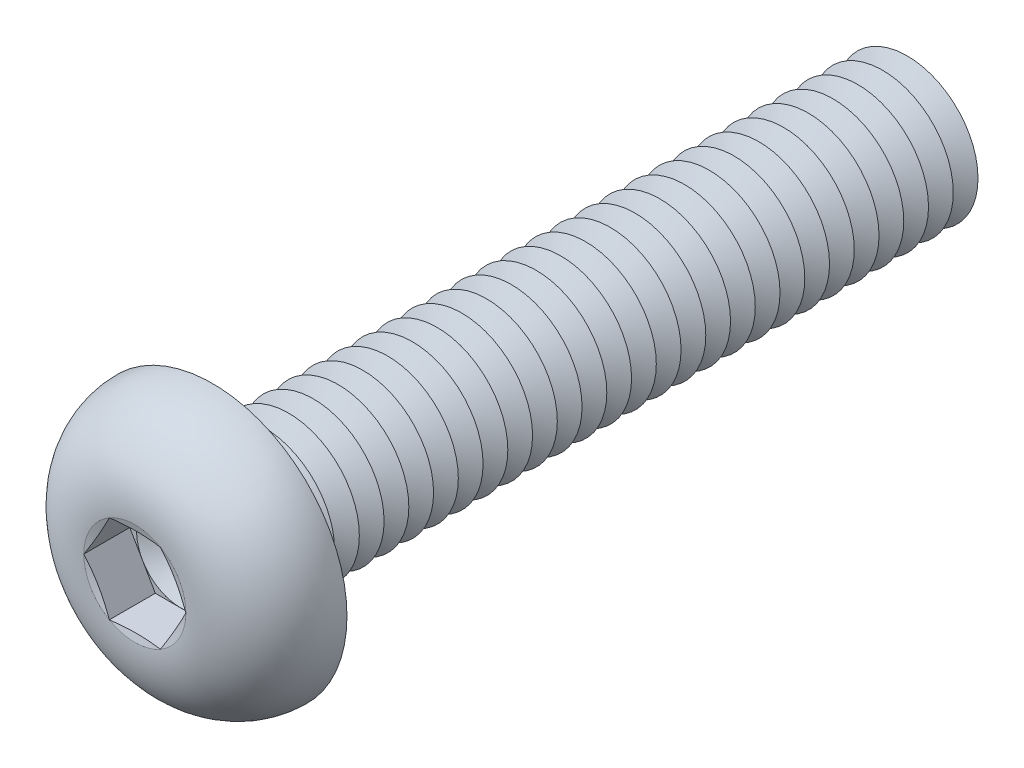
ISO-10303-21;
HEADER;
FILE_DESCRIPTION(('STEP AP214'),'2;1');
FILE_NAME('part.step','',(''),(''),'','','');
FILE_SCHEMA(('AUTOMOTIVE_DESIGN { 1 0 10303 214 1 1 1 1 }'));
ENDSEC;
DATA;
#1=APPLICATION_CONTEXT('core data for automotive mechanical design processes');
#2=APPLICATION_PROTOCOL_DEFINITION('international standard','automotive_design',2000,#1);
#3=PRODUCT_CONTEXT('',#1,'mechanical');
#4=PRODUCT('Part','Part','',(#3));
#5=PRODUCT_RELATED_PRODUCT_CATEGORY('part','',(#4));
#6=PRODUCT_DEFINITION_FORMATION('','',#4);
#7=PRODUCT_DEFINITION_CONTEXT('part definition',#1,'design');
#8=PRODUCT_DEFINITION('design','',#6,#7);
#9=PRODUCT_DEFINITION_SHAPE('','',#8);
#10=(LENGTH_UNIT() NAMED_UNIT(*) SI_UNIT(.MILLI.,.METRE.));
#11=(NAMED_UNIT(*) PLANE_ANGLE_UNIT() SI_UNIT($,.RADIAN.));
#12=(NAMED_UNIT(*) SI_UNIT($,.STERADIAN.) SOLID_ANGLE_UNIT());
#13=UNCERTAINTY_MEASURE_WITH_UNIT(LENGTH_MEASURE(1.E-05),#10,'distance_accuracy_value','');
#14=(GEOMETRIC_REPRESENTATION_CONTEXT(3) GLOBAL_UNCERTAINTY_ASSIGNED_CONTEXT((#13)) GLOBAL_UNIT_ASSIGNED_CONTEXT((#10,
#11,#12)) REPRESENTATION_CONTEXT('',''));
#15=CARTESIAN_POINT('',(0.,0.,0.));
#16=DIRECTION('',(0.,0.,1.));
#17=DIRECTION('',(1.,0.,0.));
#18=AXIS2_PLACEMENT_3D('',#15,#16,#17);
#19=CARTESIAN_POINT('',(0.,0.,0.9));
#20=DIRECTION('',(0.,0.,1.));
#21=DIRECTION('',(1.,0.,0.));
#22=AXIS2_PLACEMENT_3D('',#19,#20,#21);
#23=PLANE('',#22);
#24=CARTESIAN_POINT('',(0.,0.,0.9));
#25=DIRECTION('',(0.,0.,1.));
#26=DIRECTION('',(1.,0.,0.));
#27=AXIS2_PLACEMENT_3D('',#24,#25,#26);
#28=CIRCLE('',#27,1.24999941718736);
#29=CARTESIAN_POINT('',(1.08253125,0.624999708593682,0.9));
#30=VERTEX_POINT('',#29);
#31=CARTESIAN_POINT('',(0.,1.24999941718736,0.9));
#32=VERTEX_POINT('',#31);
#33=EDGE_CURVE('E118',#30,#32,#28,.T.);
#34=ORIENTED_EDGE('',*,*,#33,.F.);
#35=DIRECTION('',(-0.5,0.866025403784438,0.));
#36=VECTOR('',#35,1.);
#37=CARTESIAN_POINT('',(1.443375,0.,0.9));
#38=LINE('',#37,#36);
#39=CARTESIAN_POINT('',(0.7216875,1.24999941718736,0.9));
#40=VERTEX_POINT('',#39);
#41=EDGE_CURVE('E125',#30,#40,#38,.T.);
#42=ORIENTED_EDGE('',*,*,#41,.T.);
#43=DIRECTION('',(-1.,0.,0.));
#44=VECTOR('',#43,1.);
#45=CARTESIAN_POINT('',(0.7216875,1.24999941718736,0.9));
#46=LINE('',#45,#44);
#47=EDGE_CURVE('E136',#40,#32,#46,.T.);
#48=ORIENTED_EDGE('',*,*,#47,.T.);
#49=EDGE_LOOP('',(#34,#42,#48));
#50=FACE_BOUND('',#49,.T.);
#51=ADVANCED_FACE('F39',(#50),#23,.T.);
#52=CARTESIAN_POINT('',(0.,0.,0.9));
#53=DIRECTION('',(0.,0.,1.));
#54=DIRECTION('',(1.,0.,0.));
#55=AXIS2_PLACEMENT_3D('',#52,#53,#54);
#56=CIRCLE('',#55,1.24999941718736);
#57=CARTESIAN_POINT('',(-1.08253125,0.624999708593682,0.9));
#58=VERTEX_POINT('',#57);
#59=EDGE_CURVE('E11',#32,#58,#56,.T.);
#60=ORIENTED_EDGE('',*,*,#59,.F.);
#61=CARTESIAN_POINT('',(-0.721687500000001,1.24999941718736,0.9));
#62=VERTEX_POINT('',#61);
#63=EDGE_CURVE('E131',#32,#62,#46,.T.);
#64=ORIENTED_EDGE('',*,*,#63,.T.);
#65=DIRECTION('',(-0.5,-0.866025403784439,0.));
#66=VECTOR('',#65,1.);
#67=CARTESIAN_POINT('',(-0.721687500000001,1.24999941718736,0.9));
#68=LINE('',#67,#66);
#69=EDGE_CURVE('E134',#62,#58,#68,.T.);
#70=ORIENTED_EDGE('',*,*,#69,.T.);
#71=EDGE_LOOP('',(#60,#64,#70));
#72=FACE_BOUND('',#71,.T.);
#73=ADVANCED_FACE('F130',(#72),#23,.T.);
#74=CARTESIAN_POINT('',(-1.08253125,-0.624999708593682,0.9));
#75=VERTEX_POINT('',#74);
#76=EDGE_CURVE('E49',#58,#75,#56,.T.);
#77=ORIENTED_EDGE('',*,*,#76,.F.);
#78=CARTESIAN_POINT('',(-1.443375,0.,0.9));
#79=VERTEX_POINT('',#78);
#80=EDGE_CURVE('E143',#58,#79,#68,.T.);
#81=ORIENTED_EDGE('',*,*,#80,.T.);
#82=DIRECTION('',(0.5,-0.866025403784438,0.));
#83=VECTOR('',#82,1.);
#84=CARTESIAN_POINT('',(-1.443375,0.,0.9));
#85=LINE('',#84,#83);
#86=EDGE_CURVE('E152',#79,#75,#85,.T.);
#87=ORIENTED_EDGE('',*,*,#86,.T.);
#88=EDGE_LOOP('',(#77,#81,#87));
#89=FACE_BOUND('',#88,.T.);
#90=ADVANCED_FACE('F496',(#89),#23,.T.);
#91=CARTESIAN_POINT('',(0.,-1.24999941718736,0.9));
#92=VERTEX_POINT('',#91);
#93=EDGE_CURVE('E481',#75,#92,#56,.T.);
#94=ORIENTED_EDGE('',*,*,#93,.F.);
#95=CARTESIAN_POINT('',(-0.721687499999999,-1.24999941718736,0.9));
#96=VERTEX_POINT('',#95);
#97=EDGE_CURVE('E151',#75,#96,#85,.T.);
#98=ORIENTED_EDGE('',*,*,#97,.T.);
#99=DIRECTION('',(1.,0.,0.));
#100=VECTOR('',#99,1.);
#101=CARTESIAN_POINT('',(-0.721687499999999,-1.24999941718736,0.9));
#102=LINE('',#101,#100);
#103=EDGE_CURVE('E157',#96,#92,#102,.T.);
#104=ORIENTED_EDGE('',*,*,#103,.T.);
#105=EDGE_LOOP('',(#94,#98,#104));
#106=FACE_BOUND('',#105,.T.);
#107=ADVANCED_FACE('F489',(#106),#23,.T.);
#108=CARTESIAN_POINT('',(1.08253125,-0.624999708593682,0.9));
#109=VERTEX_POINT('',#108);
#110=EDGE_CURVE('E56',#92,#109,#56,.T.);
#111=ORIENTED_EDGE('',*,*,#110,.F.);
#112=CARTESIAN_POINT('',(0.721687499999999,-1.24999941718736,0.9));
#113=VERTEX_POINT('',#112);
#114=EDGE_CURVE('E156',#92,#113,#102,.T.);
#115=ORIENTED_EDGE('',*,*,#114,.T.);
#116=DIRECTION('',(0.5,0.866025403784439,0.));
#117=VECTOR('',#116,1.);
#118=CARTESIAN_POINT('',(0.721687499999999,-1.24999941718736,0.9));
#119=LINE('',#118,#117);
#120=EDGE_CURVE('E162',#113,#109,#119,.T.);
#121=ORIENTED_EDGE('',*,*,#120,.T.);
#122=EDGE_LOOP('',(#111,#115,#121));
#123=FACE_BOUND('',#122,.T.);
#124=ADVANCED_FACE('F578',(#123),#23,.T.);
#125=CARTESIAN_POINT('',(0.,0.,2.2));
#126=DIRECTION('',(0.,0.,1.));
#127=DIRECTION('',(1.,0.,0.));
#128=AXIS2_PLACEMENT_3D('',#125,#126,#127);
#129=CONICAL_SURFACE('',#128,1.443375,1.30899693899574);
#130=CARTESIAN_POINT('',(1.44349047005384,-0.000199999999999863,2.20003094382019));
#131=CARTESIAN_POINT('',(1.41351104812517,0.0517258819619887,2.19199301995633));
#132=CARTESIAN_POINT('',(1.38347725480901,0.10374593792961,2.18469579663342));
#133=CARTESIAN_POINT('',(1.32330355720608,0.207969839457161,2.17187512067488));
#134=CARTESIAN_POINT('',(1.29316361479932,0.260173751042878,2.16635238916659));
#135=CARTESIAN_POINT('',(1.23296043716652,0.364448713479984,2.15740323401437));
#136=CARTESIAN_POINT('',(1.20289760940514,0.416519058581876,2.15396613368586));
#137=CARTESIAN_POINT('',(1.14273359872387,0.520726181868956,2.14935732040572));
#138=CARTESIAN_POINT('',(1.11263242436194,0.572862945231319,2.14818516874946));
#139=CARTESIAN_POINT('',(1.05243007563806,0.677136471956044,2.14818516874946));
#140=CARTESIAN_POINT('',(1.02232890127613,0.729273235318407,2.14935732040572));
#141=CARTESIAN_POINT('',(0.962164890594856,0.833480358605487,2.15396613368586));
#142=CARTESIAN_POINT('',(0.932102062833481,0.885550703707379,2.15740323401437));
#143=CARTESIAN_POINT('',(0.87189888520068,0.989825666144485,2.16635238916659));
#144=CARTESIAN_POINT('',(0.841758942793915,1.0420295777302,2.17187512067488));
#145=CARTESIAN_POINT('',(0.781585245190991,1.14625347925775,2.18469579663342));
#146=CARTESIAN_POINT('',(0.751551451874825,1.19827353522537,2.19199301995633));
#147=CARTESIAN_POINT('',(0.721572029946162,1.25019941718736,2.20003094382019));
#148=B_SPLINE_CURVE_WITH_KNOTS('',3,(#130,#131,#132,#133,#134,#135,#136,#137,#138,#139,#140,
#141,#142,#143,#144,#145,#146,#147),.UNSPECIFIED.,.F.,.F.,(4,2,2,2,2,2,2,2,4),(0.,
0.181495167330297,0.363063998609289,0.543695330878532,0.724291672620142,0.904888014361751,
1.08551934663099,1.26708817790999,1.44858334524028),.UNSPECIFIED.);
#149=CARTESIAN_POINT('',(1.443375,0.,2.2));
#150=VERTEX_POINT('',#149);
#151=CARTESIAN_POINT('',(0.721687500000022,1.24999941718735,2.2));
#152=VERTEX_POINT('',#151);
#153=EDGE_CURVE('E221',#150,#152,#148,.T.);
#154=ORIENTED_EDGE('',*,*,#153,.F.);
#155=CARTESIAN_POINT('',(0.,0.,2.2));
#156=DIRECTION('',(0.,0.,-1.));
#157=DIRECTION('',(-1.,0.,0.));
#158=AXIS2_PLACEMENT_3D('',#155,#156,#157);
#159=CIRCLE('',#158,1.443375);
#160=EDGE_CURVE('E526',#152,#150,#159,.T.);
#161=ORIENTED_EDGE('',*,*,#160,.F.);
#162=EDGE_LOOP('',(#154,#161));
#163=FACE_BOUND('',#162,.T.);
#164=ADVANCED_FACE('F545',(#163),#129,.F.);
#165=CARTESIAN_POINT('',(0.721572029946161,-1.25019941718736,2.20003094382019));
#166=CARTESIAN_POINT('',(0.751551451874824,-1.19827353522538,2.19199301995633));
#167=CARTESIAN_POINT('',(0.78158524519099,-1.14625347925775,2.18469579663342));
#168=CARTESIAN_POINT('',(0.841758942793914,-1.0420295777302,2.17187512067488));
#169=CARTESIAN_POINT('',(0.87189888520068,-0.989825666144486,2.16635238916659));
#170=CARTESIAN_POINT('',(0.932102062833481,-0.88555070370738,2.15740323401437));
#171=CARTESIAN_POINT('',(0.962164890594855,-0.833480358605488,2.15396613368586));
#172=CARTESIAN_POINT('',(1.02232890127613,-0.729273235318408,2.14935732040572));
#173=CARTESIAN_POINT('',(1.05243007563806,-0.677136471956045,2.14818516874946));
#174=CARTESIAN_POINT('',(1.11263242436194,-0.572862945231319,2.14818516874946));
#175=CARTESIAN_POINT('',(1.14273359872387,-0.520726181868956,2.14935732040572));
#176=CARTESIAN_POINT('',(1.20289760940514,-0.416519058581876,2.15396613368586));
#177=CARTESIAN_POINT('',(1.23296043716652,-0.364448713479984,2.15740323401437));
#178=CARTESIAN_POINT('',(1.29316361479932,-0.260173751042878,2.16635238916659));
#179=CARTESIAN_POINT('',(1.32330355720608,-0.207969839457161,2.17187512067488));
#180=CARTESIAN_POINT('',(1.38347725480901,-0.10374593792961,2.18469579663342));
#181=CARTESIAN_POINT('',(1.41351104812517,-0.0517258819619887,2.19199301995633));
#182=CARTESIAN_POINT('',(1.44349047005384,0.000199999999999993,2.20003094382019));
#183=B_SPLINE_CURVE_WITH_KNOTS('',3,(#165,#166,#167,#168,#169,#170,#171,#172,#173,#174,#175,
#176,#177,#178,#179,#180,#181,#182),.UNSPECIFIED.,.F.,.F.,(4,2,2,2,2,2,2,2,4),(0.,
0.181495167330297,0.36306399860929,0.543695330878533,0.724291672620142,0.904888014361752,
1.085519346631,1.26708817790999,1.44858334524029),.UNSPECIFIED.);
#184=CARTESIAN_POINT('',(0.721687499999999,-1.24999941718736,2.2));
#185=VERTEX_POINT('',#184);
#186=EDGE_CURVE('E230',#185,#150,#183,.T.);
#187=ORIENTED_EDGE('',*,*,#186,.F.);
#188=EDGE_CURVE('E528',#150,#185,#159,.T.);
#189=ORIENTED_EDGE('',*,*,#188,.F.);
#190=EDGE_LOOP('',(#187,#189));
#191=FACE_BOUND('',#190,.T.);
#192=ADVANCED_FACE('F547',(#191),#129,.F.);
#193=CARTESIAN_POINT('',(-2.17815859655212,-1.24999941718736,2.48616275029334));
#194=CARTESIAN_POINT('',(-2.07269794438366,-1.24999941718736,2.4616881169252));
#195=CARTESIAN_POINT('',(-1.96714913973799,-1.24999941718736,2.43756889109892));
#196=CARTESIAN_POINT('',(-1.75576352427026,-1.24999941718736,2.39052699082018));
#197=CARTESIAN_POINT('',(-1.64992665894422,-1.24999941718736,2.36760456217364));
#198=CARTESIAN_POINT('',(-1.43690237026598,-1.24999941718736,2.3232454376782));
#199=CARTESIAN_POINT('',(-1.32971158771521,-1.24999941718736,2.30182468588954));
#200=CARTESIAN_POINT('',(-1.1148274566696,-1.24999941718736,2.26156703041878));
#201=CARTESIAN_POINT('',(-1.00713406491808,-1.24999941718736,2.24273035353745));
#202=CARTESIAN_POINT('',(-0.794044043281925,-1.24999941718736,2.2093913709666));
#203=CARTESIAN_POINT('',(-0.688664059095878,-1.24999941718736,2.19478562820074));
#204=CARTESIAN_POINT('',(-0.477310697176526,-1.24999941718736,2.17085809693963));
#205=CARTESIAN_POINT('',(-0.371337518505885,-1.24999941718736,2.16153463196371));
#206=CARTESIAN_POINT('',(-0.159455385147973,-1.24999941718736,2.14976770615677));
#207=CARTESIAN_POINT('',(-0.0535482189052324,-1.24999941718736,2.14729400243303));
#208=CARTESIAN_POINT('',(0.158189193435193,-1.24999941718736,2.14966287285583));
#209=CARTESIAN_POINT('',(0.264019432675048,-1.24999941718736,2.15450603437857));
#210=CARTESIAN_POINT('',(0.445148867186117,-1.24999941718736,2.16825380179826));
#211=CARTESIAN_POINT('',(0.520574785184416,-1.24999941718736,2.17561242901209));
#212=CARTESIAN_POINT('',(0.671115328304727,-1.24999941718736,2.19297000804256));
#213=CARTESIAN_POINT('',(0.746229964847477,-1.24999941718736,2.20296886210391));
#214=CARTESIAN_POINT('',(0.896387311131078,-1.24999941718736,2.22505910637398));
#215=CARTESIAN_POINT('',(0.971429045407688,-1.24999941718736,2.23715700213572));
#216=CARTESIAN_POINT('',(1.12124320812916,-1.24999941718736,2.26292371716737));
#217=CARTESIAN_POINT('',(1.19601562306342,-1.24999941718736,2.27659261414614));
#218=CARTESIAN_POINT('',(1.34686913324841,-1.24999941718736,2.30540811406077));
#219=CARTESIAN_POINT('',(1.42294548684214,-1.24999941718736,2.32057934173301));
#220=CARTESIAN_POINT('',(1.57490676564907,-1.24999941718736,2.351851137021));
#221=CARTESIAN_POINT('',(1.65079168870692,-1.24999941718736,2.36795171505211));
#222=CARTESIAN_POINT('',(1.80199501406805,-1.24999941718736,2.40076814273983));
#223=CARTESIAN_POINT('',(1.87731425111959,-1.24999941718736,2.41748016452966));
#224=CARTESIAN_POINT('',(2.02782424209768,-1.24999941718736,2.45144971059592));
#225=CARTESIAN_POINT('',(2.10301500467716,-1.24999941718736,2.46870719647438));
#226=CARTESIAN_POINT('',(2.17815859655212,-1.24999941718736,2.48616275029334));
#227=B_SPLINE_CURVE_WITH_KNOTS('',3,(#193,#194,#195,#196,#197,#198,#199,#200,#201,#202,#203,
#204,#205,#206,#207,#208,#209,#210,#211,#212,#213,#214,#215,#216,#217,#218,#219,#220,#221,#222,
#223,#224,#225,#226),.UNSPECIFIED.,.F.,.F.,(4,2,2,2,2,2,2,2,2,2,2,2,2,2,2,2,4),(0.,
0.324797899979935,0.649662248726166,0.977572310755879,1.30551113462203,1.62458166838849,
1.94355087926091,2.26110952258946,2.57869365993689,2.80599541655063,3.03328875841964,
3.2612995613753,3.48932164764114,3.7220371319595,3.95475522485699,4.18620606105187,
4.41764064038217),.UNSPECIFIED.);
#228=CARTESIAN_POINT('',(-0.721687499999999,-1.24999941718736,2.2));
#229=VERTEX_POINT('',#228);
#230=EDGE_CURVE('E508',#229,#185,#227,.T.);
#231=ORIENTED_EDGE('',*,*,#230,.F.);
#232=EDGE_CURVE('E516',#185,#229,#159,.T.);
#233=ORIENTED_EDGE('',*,*,#232,.F.);
#234=EDGE_LOOP('',(#231,#233));
#235=FACE_BOUND('',#234,.T.);
#236=ADVANCED_FACE('F551',(#235),#129,.F.);
#237=CARTESIAN_POINT('',(-1.44349047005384,0.000200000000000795,2.20003094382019));
#238=CARTESIAN_POINT('',(-1.41351104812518,-0.0517258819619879,2.19199301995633));
#239=CARTESIAN_POINT('',(-1.38347725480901,-0.10374593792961,2.18469579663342));
#240=CARTESIAN_POINT('',(-1.32330355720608,-0.20796983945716,2.17187512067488));
#241=CARTESIAN_POINT('',(-1.29316361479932,-0.260173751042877,2.16635238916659));
#242=CARTESIAN_POINT('',(-1.23296043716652,-0.364448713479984,2.15740323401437));
#243=CARTESIAN_POINT('',(-1.20289760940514,-0.416519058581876,2.15396613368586));
#244=CARTESIAN_POINT('',(-1.14273359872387,-0.520726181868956,2.14935732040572));
#245=CARTESIAN_POINT('',(-1.11263242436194,-0.572862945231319,2.14818516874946));
#246=CARTESIAN_POINT('',(-1.05243007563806,-0.677136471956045,2.14818516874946));
#247=CARTESIAN_POINT('',(-1.02232890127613,-0.729273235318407,2.14935732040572));
#248=CARTESIAN_POINT('',(-0.962164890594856,-0.833480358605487,2.15396613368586));
#249=CARTESIAN_POINT('',(-0.932102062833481,-0.885550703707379,2.15740323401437));
#250=CARTESIAN_POINT('',(-0.87189888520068,-0.989825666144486,2.16635238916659));
#251=CARTESIAN_POINT('',(-0.841758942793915,-1.0420295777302,2.17187512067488));
#252=CARTESIAN_POINT('',(-0.78158524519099,-1.14625347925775,2.18469579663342));
#253=CARTESIAN_POINT('',(-0.751551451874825,-1.19827353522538,2.19199301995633));
#254=CARTESIAN_POINT('',(-0.721572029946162,-1.25019941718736,2.20003094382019));
#255=B_SPLINE_CURVE_WITH_KNOTS('',3,(#237,#238,#239,#240,#241,#242,#243,#244,#245,#246,#247,
#248,#249,#250,#251,#252,#253,#254),.UNSPECIFIED.,.F.,.F.,(4,2,2,2,2,2,2,2,4),(0.,
0.181495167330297,0.36306399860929,0.543695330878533,0.724291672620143,0.904888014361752,
1.085519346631,1.26708817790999,1.44858334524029),.UNSPECIFIED.);
#256=CARTESIAN_POINT('',(-1.443375,0.,2.2));
#257=VERTEX_POINT('',#256);
#258=EDGE_CURVE('E501',#257,#229,#255,.T.);
#259=ORIENTED_EDGE('',*,*,#258,.F.);
#260=EDGE_CURVE('E459',#229,#257,#159,.T.);
#261=ORIENTED_EDGE('',*,*,#260,.F.);
#262=EDGE_LOOP('',(#259,#261));
#263=FACE_BOUND('',#262,.T.);
#264=ADVANCED_FACE('F505',(#263),#129,.F.);
#265=CARTESIAN_POINT('',(-0.721572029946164,1.25019941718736,2.20003094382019));
#266=CARTESIAN_POINT('',(-0.751551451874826,1.19827353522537,2.19199301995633));
#267=CARTESIAN_POINT('',(-0.781585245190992,1.14625347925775,2.18469579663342));
#268=CARTESIAN_POINT('',(-0.841758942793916,1.0420295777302,2.17187512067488));
#269=CARTESIAN_POINT('',(-0.871898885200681,0.989825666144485,2.16635238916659));
#270=CARTESIAN_POINT('',(-0.932102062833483,0.885550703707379,2.15740323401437));
#271=CARTESIAN_POINT('',(-0.962164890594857,0.833480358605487,2.15396613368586));
#272=CARTESIAN_POINT('',(-1.02232890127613,0.729273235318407,2.14935732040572));
#273=CARTESIAN_POINT('',(-1.05243007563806,0.677136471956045,2.14818516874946));
#274=CARTESIAN_POINT('',(-1.11263242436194,0.572862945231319,2.14818516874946));
#275=CARTESIAN_POINT('',(-1.14273359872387,0.520726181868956,2.14935732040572));
#276=CARTESIAN_POINT('',(-1.20289760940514,0.416519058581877,2.15396613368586));
#277=CARTESIAN_POINT('',(-1.23296043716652,0.364448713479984,2.15740323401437));
#278=CARTESIAN_POINT('',(-1.29316361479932,0.260173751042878,2.16635238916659));
#279=CARTESIAN_POINT('',(-1.32330355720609,0.207969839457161,2.17187512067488));
#280=CARTESIAN_POINT('',(-1.38347725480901,0.103745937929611,2.18469579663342));
#281=CARTESIAN_POINT('',(-1.41351104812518,0.0517258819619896,2.19199301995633));
#282=CARTESIAN_POINT('',(-1.44349047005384,-0.00019999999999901,2.20003094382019));
#283=B_SPLINE_CURVE_WITH_KNOTS('',3,(#265,#266,#267,#268,#269,#270,#271,#272,#273,#274,#275,
#276,#277,#278,#279,#280,#281,#282),.UNSPECIFIED.,.F.,.F.,(4,2,2,2,2,2,2,2,4),(0.,
0.181495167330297,0.363063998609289,0.543695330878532,0.724291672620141,0.90488801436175,
1.08551934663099,1.26708817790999,1.44858334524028),.UNSPECIFIED.);
#284=CARTESIAN_POINT('',(-0.721687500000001,1.24999941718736,2.2));
#285=VERTEX_POINT('',#284);
#286=EDGE_CURVE('E194',#285,#257,#283,.T.);
#287=ORIENTED_EDGE('',*,*,#286,.F.);
#288=EDGE_CURVE('E460',#257,#285,#159,.T.);
#289=ORIENTED_EDGE('',*,*,#288,.F.);
#290=EDGE_LOOP('',(#287,#289));
#291=FACE_BOUND('',#290,.T.);
#292=ADVANCED_FACE('F519',(#291),#129,.F.);
#293=CARTESIAN_POINT('',(0.,0.,-17.55));
#294=DIRECTION('',(0.,0.,1.));
#295=DIRECTION('',(1.,0.,0.));
#296=AXIS2_PLACEMENT_3D('',#293,#294,#295);
#297=CONICAL_SURFACE('',#296,2.00000000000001,1.0471975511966);
#298=CARTESIAN_POINT('',(0.,0.,-17.9));
#299=DIRECTION('',(0.,0.,1.));
#300=DIRECTION('',(1.,0.,0.));
#301=AXIS2_PLACEMENT_3D('',#298,#299,#300);
#302=CIRCLE('',#301,1.3937822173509);
#303=CARTESIAN_POINT('',(1.3937822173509,0.,-17.9));
#304=VERTEX_POINT('',#303);
#305=EDGE_CURVE('E431',#304,#304,#302,.T.);
#306=ORIENTED_EDGE('',*,*,#305,.T.);
#307=EDGE_LOOP('',(#306));
#308=FACE_BOUND('',#307,.T.);
#309=CARTESIAN_POINT('',(0.,0.,-17.55));
#310=DIRECTION('',(0.,0.,1.));
#311=DIRECTION('',(1.,0.,0.));
#312=AXIS2_PLACEMENT_3D('',#309,#310,#311);
#313=CIRCLE('',#312,2.00000000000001);
#314=CARTESIAN_POINT('',(2.00000000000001,0.,-17.55));
#315=VERTEX_POINT('',#314);
#316=EDGE_CURVE('E427',#315,#315,#313,.T.);
#317=ORIENTED_EDGE('',*,*,#316,.F.);
#318=EDGE_LOOP('',(#317));
#319=FACE_BOUND('',#318,.T.);
#320=ADVANCED_FACE('F631',(#308,#319),#297,.T.);
#321=CARTESIAN_POINT('',(0.,0.,-17.9));
#322=DIRECTION('',(0.,0.,-1.));
#323=DIRECTION('',(-1.,0.,0.));
#324=AXIS2_PLACEMENT_3D('',#321,#322,#323);
#325=CONICAL_SURFACE('',#324,1.3937822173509,1.0471975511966);
#326=CARTESIAN_POINT('',(0.,0.,-18.25));
#327=DIRECTION('',(0.,0.,1.));
#328=DIRECTION('',(1.,0.,0.));
#329=AXIS2_PLACEMENT_3D('',#326,#327,#328);
#330=CIRCLE('',#329,2.00000000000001);
#331=CARTESIAN_POINT('',(2.00000000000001,0.,-18.25));
#332=VERTEX_POINT('',#331);
#333=EDGE_CURVE('E435',#332,#332,#330,.T.);
#334=ORIENTED_EDGE('',*,*,#333,.T.);
#335=EDGE_LOOP('',(#334));
#336=FACE_BOUND('',#335,.T.);
#337=ORIENTED_EDGE('',*,*,#305,.F.);
#338=EDGE_LOOP('',(#337));
#339=FACE_BOUND('',#338,.T.);
#340=ADVANCED_FACE('F1194',(#336,#339),#325,.T.);
#341=CARTESIAN_POINT('',(0.,2.00000000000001,-20.));
#342=DIRECTION('',(0.,0.,-1.));
#343=DIRECTION('',(-1.,0.,0.));
#344=AXIS2_PLACEMENT_3D('',#341,#342,#343);
#345=PLANE('',#344);
#346=CARTESIAN_POINT('',(0.,0.,-20.));
#347=DIRECTION('',(0.,0.,1.));
#348=DIRECTION('',(1.,0.,0.));
#349=AXIS2_PLACEMENT_3D('',#346,#347,#348);
#350=CIRCLE('',#349,1.3937822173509);
#351=CARTESIAN_POINT('',(1.3937822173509,0.,-20.));
#352=VERTEX_POINT('',#351);
#353=EDGE_CURVE('E455',#352,#352,#350,.T.);
#354=ORIENTED_EDGE('',*,*,#353,.F.);
#355=EDGE_LOOP('',(#354));
#356=FACE_BOUND('',#355,.T.);
#357=ADVANCED_FACE('F1199',(#356),#345,.T.);
#358=CARTESIAN_POINT('',(0.,0.,-19.65));
#359=DIRECTION('',(0.,0.,1.));
#360=DIRECTION('',(1.,0.,0.));
#361=AXIS2_PLACEMENT_3D('',#358,#359,#360);
#362=CONICAL_SURFACE('',#361,2.00000000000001,1.0471975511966);
#363=ORIENTED_EDGE('',*,*,#353,.T.);
#364=EDGE_LOOP('',(#363));
#365=FACE_BOUND('',#364,.T.);
#366=CARTESIAN_POINT('',(0.,0.,-19.65));
#367=DIRECTION('',(0.,0.,1.));
#368=DIRECTION('',(1.,0.,0.));
#369=AXIS2_PLACEMENT_3D('',#366,#367,#368);
#370=CIRCLE('',#369,2.00000000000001);
#371=CARTESIAN_POINT('',(2.00000000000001,0.,-19.65));
#372=VERTEX_POINT('',#371);
#373=EDGE_CURVE('E451',#372,#372,#370,.T.);
#374=ORIENTED_EDGE('',*,*,#373,.F.);
#375=EDGE_LOOP('',(#374));
#376=FACE_BOUND('',#375,.T.);
#377=ADVANCED_FACE('F1187',(#365,#376),#362,.T.);
#378=CARTESIAN_POINT('',(0.,0.,-19.3));
#379=DIRECTION('',(0.,0.,-1.));
#380=DIRECTION('',(-1.,0.,0.));
#381=AXIS2_PLACEMENT_3D('',#378,#379,#380);
#382=CONICAL_SURFACE('',#381,1.3937822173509,1.0471975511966);
#383=ORIENTED_EDGE('',*,*,#373,.T.);
#384=EDGE_LOOP('',(#383));
#385=FACE_BOUND('',#384,.T.);
#386=CARTESIAN_POINT('',(0.,0.,-19.3));
#387=DIRECTION('',(0.,0.,1.));
#388=DIRECTION('',(1.,0.,0.));
#389=AXIS2_PLACEMENT_3D('',#386,#387,#388);
#390=CIRCLE('',#389,1.3937822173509);
#391=CARTESIAN_POINT('',(1.3937822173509,0.,-19.3));
#392=VERTEX_POINT('',#391);
#393=EDGE_CURVE('E447',#392,#392,#390,.T.);
#394=ORIENTED_EDGE('',*,*,#393,.F.);
#395=EDGE_LOOP('',(#394));
#396=FACE_BOUND('',#395,.T.);
#397=ADVANCED_FACE('F1177',(#385,#396),#382,.T.);
#398=CARTESIAN_POINT('',(0.,0.,-18.95));
#399=DIRECTION('',(0.,0.,1.));
#400=DIRECTION('',(1.,0.,0.));
#401=AXIS2_PLACEMENT_3D('',#398,#399,#400);
#402=CONICAL_SURFACE('',#401,2.00000000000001,1.0471975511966);
#403=ORIENTED_EDGE('',*,*,#393,.T.);
#404=EDGE_LOOP('',(#403));
#405=FACE_BOUND('',#404,.T.);
#406=CARTESIAN_POINT('',(0.,0.,-18.95));
#407=DIRECTION('',(0.,0.,1.));
#408=DIRECTION('',(1.,0.,0.));
#409=AXIS2_PLACEMENT_3D('',#406,#407,#408);
#410=CIRCLE('',#409,2.00000000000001);
#411=CARTESIAN_POINT('',(2.00000000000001,0.,-18.95));
#412=VERTEX_POINT('',#411);
#413=EDGE_CURVE('E443',#412,#412,#410,.T.);
#414=ORIENTED_EDGE('',*,*,#413,.F.);
#415=EDGE_LOOP('',(#414));
#416=FACE_BOUND('',#415,.T.);
#417=ADVANCED_FACE('F1167',(#405,#416),#402,.T.);
#418=CARTESIAN_POINT('',(0.,0.,-18.6));
#419=DIRECTION('',(0.,0.,-1.));
#420=DIRECTION('',(-1.,0.,0.));
#421=AXIS2_PLACEMENT_3D('',#418,#419,#420);
#422=CONICAL_SURFACE('',#421,1.3937822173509,1.0471975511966);
#423=ORIENTED_EDGE('',*,*,#413,.T.);
#424=EDGE_LOOP('',(#423));
#425=FACE_BOUND('',#424,.T.);
#426=CARTESIAN_POINT('',(0.,0.,-18.6));
#427=DIRECTION('',(0.,0.,1.));
#428=DIRECTION('',(1.,0.,0.));
#429=AXIS2_PLACEMENT_3D('',#426,#427,#428);
#430=CIRCLE('',#429,1.3937822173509);
#431=CARTESIAN_POINT('',(1.3937822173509,0.,-18.6));
#432=VERTEX_POINT('',#431);
#433=EDGE_CURVE('E439',#432,#432,#430,.T.);
#434=ORIENTED_EDGE('',*,*,#433,.F.);
#435=EDGE_LOOP('',(#434));
#436=FACE_BOUND('',#435,.T.);
#437=ADVANCED_FACE('F1157',(#425,#436),#422,.T.);
#438=CARTESIAN_POINT('',(0.,0.,-18.25));
#439=DIRECTION('',(0.,0.,1.));
#440=DIRECTION('',(1.,0.,0.));
#441=AXIS2_PLACEMENT_3D('',#438,#439,#440);
#442=CONICAL_SURFACE('',#441,2.00000000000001,1.0471975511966);
#443=ORIENTED_EDGE('',*,*,#433,.T.);
#444=EDGE_LOOP('',(#443));
#445=FACE_BOUND('',#444,.T.);
#446=ORIENTED_EDGE('',*,*,#333,.F.);
#447=EDGE_LOOP('',(#446));
#448=FACE_BOUND('',#447,.T.);
#449=ADVANCED_FACE('F1147',(#445,#448),#442,.T.);
#450=CARTESIAN_POINT('',(0.,0.,-16.85));
#451=DIRECTION('',(0.,0.,1.));
#452=DIRECTION('',(1.,0.,0.));
#453=AXIS2_PLACEMENT_3D('',#450,#451,#452);
#454=CONICAL_SURFACE('',#453,2.00000000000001,1.0471975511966);
#455=CARTESIAN_POINT('',(0.,0.,-17.2));
#456=DIRECTION('',(0.,0.,1.));
#457=DIRECTION('',(1.,0.,0.));
#458=AXIS2_PLACEMENT_3D('',#455,#456,#457);
#459=CIRCLE('',#458,1.3937822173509);
#460=CARTESIAN_POINT('',(1.3937822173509,0.,-17.2));
#461=VERTEX_POINT('',#460);
#462=EDGE_CURVE('E423',#461,#461,#459,.T.);
#463=ORIENTED_EDGE('',*,*,#462,.T.);
#464=EDGE_LOOP('',(#463));
#465=FACE_BOUND('',#464,.T.);
#466=CARTESIAN_POINT('',(0.,0.,-16.85));
#467=DIRECTION('',(0.,0.,1.));
#468=DIRECTION('',(1.,0.,0.));
#469=AXIS2_PLACEMENT_3D('',#466,#467,#468);
#470=CIRCLE('',#469,2.00000000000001);
#471=CARTESIAN_POINT('',(2.00000000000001,0.,-16.85));
#472=VERTEX_POINT('',#471);
#473=EDGE_CURVE('E419',#472,#472,#470,.T.);
#474=ORIENTED_EDGE('',*,*,#473,.F.);
#475=EDGE_LOOP('',(#474));
#476=FACE_BOUND('',#475,.T.);
#477=ADVANCED_FACE('F1137',(#465,#476),#454,.T.);
#478=CARTESIAN_POINT('',(0.,0.,-17.2));
#479=DIRECTION('',(0.,0.,-1.));
#480=DIRECTION('',(-1.,0.,0.));
#481=AXIS2_PLACEMENT_3D('',#478,#479,#480);
#482=CONICAL_SURFACE('',#481,1.3937822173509,1.0471975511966);
#483=ORIENTED_EDGE('',*,*,#316,.T.);
#484=EDGE_LOOP('',(#483));
#485=FACE_BOUND('',#484,.T.);
#486=ORIENTED_EDGE('',*,*,#462,.F.);
#487=EDGE_LOOP('',(#486));
#488=FACE_BOUND('',#487,.T.);
#489=ADVANCED_FACE('F1127',(#485,#488),#482,.T.);
#490=CARTESIAN_POINT('',(0.,0.,-16.15));
#491=DIRECTION('',(0.,0.,1.));
#492=DIRECTION('',(1.,0.,0.));
#493=AXIS2_PLACEMENT_3D('',#490,#491,#492);
#494=CONICAL_SURFACE('',#493,2.00000000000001,1.0471975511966);
#495=CARTESIAN_POINT('',(0.,0.,-16.5));
#496=DIRECTION('',(0.,0.,1.));
#497=DIRECTION('',(1.,0.,0.));
#498=AXIS2_PLACEMENT_3D('',#495,#496,#497);
#499=CIRCLE('',#498,1.3937822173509);
#500=CARTESIAN_POINT('',(1.3937822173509,0.,-16.5));
#501=VERTEX_POINT('',#500);
#502=EDGE_CURVE('E415',#501,#501,#499,.T.);
#503=ORIENTED_EDGE('',*,*,#502,.T.);
#504=EDGE_LOOP('',(#503));
#505=FACE_BOUND('',#504,.T.);
#506=CARTESIAN_POINT('',(0.,0.,-16.15));
#507=DIRECTION('',(0.,0.,1.));
#508=DIRECTION('',(1.,0.,0.));
#509=AXIS2_PLACEMENT_3D('',#506,#507,#508);
#510=CIRCLE('',#509,2.00000000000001);
#511=CARTESIAN_POINT('',(2.00000000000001,0.,-16.15));
#512=VERTEX_POINT('',#511);
#513=EDGE_CURVE('E411',#512,#512,#510,.T.);
#514=ORIENTED_EDGE('',*,*,#513,.F.);
#515=EDGE_LOOP('',(#514));
#516=FACE_BOUND('',#515,.T.);
#517=ADVANCED_FACE('F1117',(#505,#516),#494,.T.);
#518=CARTESIAN_POINT('',(0.,0.,-16.5));
#519=DIRECTION('',(0.,0.,-1.));
#520=DIRECTION('',(-1.,0.,0.));
#521=AXIS2_PLACEMENT_3D('',#518,#519,#520);
#522=CONICAL_SURFACE('',#521,1.3937822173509,1.0471975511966);
#523=ORIENTED_EDGE('',*,*,#473,.T.);
#524=EDGE_LOOP('',(#523));
#525=FACE_BOUND('',#524,.T.);
#526=ORIENTED_EDGE('',*,*,#502,.F.);
#527=EDGE_LOOP('',(#526));
#528=FACE_BOUND('',#527,.T.);
#529=ADVANCED_FACE('F1107',(#525,#528),#522,.T.);
#530=CARTESIAN_POINT('',(0.,0.,-15.45));
#531=DIRECTION('',(0.,0.,1.));
#532=DIRECTION('',(1.,0.,0.));
#533=AXIS2_PLACEMENT_3D('',#530,#531,#532);
#534=CONICAL_SURFACE('',#533,2.00000000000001,1.0471975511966);
#535=CARTESIAN_POINT('',(0.,0.,-15.8));
#536=DIRECTION('',(0.,0.,1.));
#537=DIRECTION('',(1.,0.,0.));
#538=AXIS2_PLACEMENT_3D('',#535,#536,#537);
#539=CIRCLE('',#538,1.3937822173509);
#540=CARTESIAN_POINT('',(1.3937822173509,0.,-15.8));
#541=VERTEX_POINT('',#540);
#542=EDGE_CURVE('E407',#541,#541,#539,.T.);
#543=ORIENTED_EDGE('',*,*,#542,.T.);
#544=EDGE_LOOP('',(#543));
#545=FACE_BOUND('',#544,.T.);
#546=CARTESIAN_POINT('',(0.,0.,-15.45));
#547=DIRECTION('',(0.,0.,1.));
#548=DIRECTION('',(1.,0.,0.));
#549=AXIS2_PLACEMENT_3D('',#546,#547,#548);
#550=CIRCLE('',#549,2.00000000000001);
#551=CARTESIAN_POINT('',(2.00000000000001,0.,-15.45));
#552=VERTEX_POINT('',#551);
#553=EDGE_CURVE('E403',#552,#552,#550,.T.);
#554=ORIENTED_EDGE('',*,*,#553,.F.);
#555=EDGE_LOOP('',(#554));
#556=FACE_BOUND('',#555,.T.);
#557=ADVANCED_FACE('F1097',(#545,#556),#534,.T.);
#558=CARTESIAN_POINT('',(0.,0.,-15.8));
#559=DIRECTION('',(0.,0.,-1.));
#560=DIRECTION('',(-1.,0.,0.));
#561=AXIS2_PLACEMENT_3D('',#558,#559,#560);
#562=CONICAL_SURFACE('',#561,1.3937822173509,1.0471975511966);
#563=ORIENTED_EDGE('',*,*,#513,.T.);
#564=EDGE_LOOP('',(#563));
#565=FACE_BOUND('',#564,.T.);
#566=ORIENTED_EDGE('',*,*,#542,.F.);
#567=EDGE_LOOP('',(#566));
#568=FACE_BOUND('',#567,.T.);
#569=ADVANCED_FACE('F1087',(#565,#568),#562,.T.);
#570=CARTESIAN_POINT('',(0.,0.,-14.75));
#571=DIRECTION('',(0.,0.,1.));
#572=DIRECTION('',(1.,0.,0.));
#573=AXIS2_PLACEMENT_3D('',#570,#571,#572);
#574=CONICAL_SURFACE('',#573,2.00000000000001,1.0471975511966);
#575=CARTESIAN_POINT('',(0.,0.,-15.1));
#576=DIRECTION('',(0.,0.,1.));
#577=DIRECTION('',(1.,0.,0.));
#578=AXIS2_PLACEMENT_3D('',#575,#576,#577);
#579=CIRCLE('',#578,1.3937822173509);
#580=CARTESIAN_POINT('',(1.3937822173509,0.,-15.1));
#581=VERTEX_POINT('',#580);
#582=EDGE_CURVE('E399',#581,#581,#579,.T.);
#583=ORIENTED_EDGE('',*,*,#582,.T.);
#584=EDGE_LOOP('',(#583));
#585=FACE_BOUND('',#584,.T.);
#586=CARTESIAN_POINT('',(0.,0.,-14.75));
#587=DIRECTION('',(0.,0.,1.));
#588=DIRECTION('',(1.,0.,0.));
#589=AXIS2_PLACEMENT_3D('',#586,#587,#588);
#590=CIRCLE('',#589,2.00000000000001);
#591=CARTESIAN_POINT('',(2.00000000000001,0.,-14.75));
#592=VERTEX_POINT('',#591);
#593=EDGE_CURVE('E395',#592,#592,#590,.T.);
#594=ORIENTED_EDGE('',*,*,#593,.F.);
#595=EDGE_LOOP('',(#594));
#596=FACE_BOUND('',#595,.T.);
#597=ADVANCED_FACE('F1077',(#585,#596),#574,.T.);
#598=CARTESIAN_POINT('',(0.,0.,-15.1));
#599=DIRECTION('',(0.,0.,-1.));
#600=DIRECTION('',(-1.,0.,0.));
#601=AXIS2_PLACEMENT_3D('',#598,#599,#600);
#602=CONICAL_SURFACE('',#601,1.3937822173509,1.0471975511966);
#603=ORIENTED_EDGE('',*,*,#553,.T.);
#604=EDGE_LOOP('',(#603));
#605=FACE_BOUND('',#604,.T.);
#606=ORIENTED_EDGE('',*,*,#582,.F.);
#607=EDGE_LOOP('',(#606));
#608=FACE_BOUND('',#607,.T.);
#609=ADVANCED_FACE('F1067',(#605,#608),#602,.T.);
#610=CARTESIAN_POINT('',(0.,0.,-14.05));
#611=DIRECTION('',(0.,0.,1.));
#612=DIRECTION('',(1.,0.,0.));
#613=AXIS2_PLACEMENT_3D('',#610,#611,#612);
#614=CONICAL_SURFACE('',#613,2.00000000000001,1.0471975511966);
#615=CARTESIAN_POINT('',(0.,0.,-14.4));
#616=DIRECTION('',(0.,0.,1.));
#617=DIRECTION('',(1.,0.,0.));
#618=AXIS2_PLACEMENT_3D('',#615,#616,#617);
#619=CIRCLE('',#618,1.3937822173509);
#620=CARTESIAN_POINT('',(1.3937822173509,0.,-14.4));
#621=VERTEX_POINT('',#620);
#622=EDGE_CURVE('E391',#621,#621,#619,.T.);
#623=ORIENTED_EDGE('',*,*,#622,.T.);
#624=EDGE_LOOP('',(#623));
#625=FACE_BOUND('',#624,.T.);
#626=CARTESIAN_POINT('',(0.,0.,-14.05));
#627=DIRECTION('',(0.,0.,1.));
#628=DIRECTION('',(1.,0.,0.));
#629=AXIS2_PLACEMENT_3D('',#626,#627,#628);
#630=CIRCLE('',#629,2.00000000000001);
#631=CARTESIAN_POINT('',(2.00000000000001,0.,-14.05));
#632=VERTEX_POINT('',#631);
#633=EDGE_CURVE('E387',#632,#632,#630,.T.);
#634=ORIENTED_EDGE('',*,*,#633,.F.);
#635=EDGE_LOOP('',(#634));
#636=FACE_BOUND('',#635,.T.);
#637=ADVANCED_FACE('F1057',(#625,#636),#614,.T.);
#638=CARTESIAN_POINT('',(0.,0.,-14.4));
#639=DIRECTION('',(0.,0.,-1.));
#640=DIRECTION('',(-1.,0.,0.));
#641=AXIS2_PLACEMENT_3D('',#638,#639,#640);
#642=CONICAL_SURFACE('',#641,1.3937822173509,1.0471975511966);
#643=ORIENTED_EDGE('',*,*,#593,.T.);
#644=EDGE_LOOP('',(#643));
#645=FACE_BOUND('',#644,.T.);
#646=ORIENTED_EDGE('',*,*,#622,.F.);
#647=EDGE_LOOP('',(#646));
#648=FACE_BOUND('',#647,.T.);
#649=ADVANCED_FACE('F1047',(#645,#648),#642,.T.);
#650=CARTESIAN_POINT('',(0.,0.,-13.35));
#651=DIRECTION('',(0.,0.,1.));
#652=DIRECTION('',(1.,0.,0.));
#653=AXIS2_PLACEMENT_3D('',#650,#651,#652);
#654=CONICAL_SURFACE('',#653,2.00000000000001,1.0471975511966);
#655=CARTESIAN_POINT('',(0.,0.,-13.7));
#656=DIRECTION('',(0.,0.,1.));
#657=DIRECTION('',(1.,0.,0.));
#658=AXIS2_PLACEMENT_3D('',#655,#656,#657);
#659=CIRCLE('',#658,1.3937822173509);
#660=CARTESIAN_POINT('',(1.3937822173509,0.,-13.7));
#661=VERTEX_POINT('',#660);
#662=EDGE_CURVE('E384',#661,#661,#659,.T.);
#663=ORIENTED_EDGE('',*,*,#662,.T.);
#664=EDGE_LOOP('',(#663));
#665=FACE_BOUND('',#664,.T.);
#666=CARTESIAN_POINT('',(0.,0.,-13.35));
#667=DIRECTION('',(0.,0.,1.));
#668=DIRECTION('',(1.,0.,0.));
#669=AXIS2_PLACEMENT_3D('',#666,#667,#668);
#670=CIRCLE('',#669,2.00000000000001);
#671=CARTESIAN_POINT('',(2.00000000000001,0.,-13.35));
#672=VERTEX_POINT('',#671);
#673=EDGE_CURVE('E380',#672,#672,#670,.T.);
#674=ORIENTED_EDGE('',*,*,#673,.F.);
#675=EDGE_LOOP('',(#674));
#676=FACE_BOUND('',#675,.T.);
#677=ADVANCED_FACE('F1037',(#665,#676),#654,.T.);
#678=CARTESIAN_POINT('',(0.,0.,-13.7));
#679=DIRECTION('',(0.,0.,-1.));
#680=DIRECTION('',(-1.,0.,0.));
#681=AXIS2_PLACEMENT_3D('',#678,#679,#680);
#682=CONICAL_SURFACE('',#681,1.3937822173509,1.0471975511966);
#683=ORIENTED_EDGE('',*,*,#633,.T.);
#684=EDGE_LOOP('',(#683));
#685=FACE_BOUND('',#684,.T.);
#686=ORIENTED_EDGE('',*,*,#662,.F.);
#687=EDGE_LOOP('',(#686));
#688=FACE_BOUND('',#687,.T.);
#689=ADVANCED_FACE('F1027',(#685,#688),#682,.T.);
#690=CARTESIAN_POINT('',(0.,0.,-12.65));
#691=DIRECTION('',(0.,0.,1.));
#692=DIRECTION('',(1.,0.,0.));
#693=AXIS2_PLACEMENT_3D('',#690,#691,#692);
#694=CONICAL_SURFACE('',#693,2.00000000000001,1.0471975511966);
#695=CARTESIAN_POINT('',(0.,0.,-13.));
#696=DIRECTION('',(0.,0.,1.));
#697=DIRECTION('',(1.,0.,0.));
#698=AXIS2_PLACEMENT_3D('',#695,#696,#697);
#699=CIRCLE('',#698,1.3937822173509);
#700=CARTESIAN_POINT('',(1.3937822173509,0.,-13.));
#701=VERTEX_POINT('',#700);
#702=EDGE_CURVE('E376',#701,#701,#699,.T.);
#703=ORIENTED_EDGE('',*,*,#702,.T.);
#704=EDGE_LOOP('',(#703));
#705=FACE_BOUND('',#704,.T.);
#706=CARTESIAN_POINT('',(0.,0.,-12.65));
#707=DIRECTION('',(0.,0.,1.));
#708=DIRECTION('',(1.,0.,0.));
#709=AXIS2_PLACEMENT_3D('',#706,#707,#708);
#710=CIRCLE('',#709,2.00000000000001);
#711=CARTESIAN_POINT('',(2.00000000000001,0.,-12.65));
#712=VERTEX_POINT('',#711);
#713=EDGE_CURVE('E372',#712,#712,#710,.T.);
#714=ORIENTED_EDGE('',*,*,#713,.F.);
#715=EDGE_LOOP('',(#714));
#716=FACE_BOUND('',#715,.T.);
#717=ADVANCED_FACE('F1017',(#705,#716),#694,.T.);
#718=CARTESIAN_POINT('',(0.,0.,-13.));
#719=DIRECTION('',(0.,0.,-1.));
#720=DIRECTION('',(-1.,0.,0.));
#721=AXIS2_PLACEMENT_3D('',#718,#719,#720);
#722=CONICAL_SURFACE('',#721,1.3937822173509,1.0471975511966);
#723=ORIENTED_EDGE('',*,*,#673,.T.);
#724=EDGE_LOOP('',(#723));
#725=FACE_BOUND('',#724,.T.);
#726=ORIENTED_EDGE('',*,*,#702,.F.);
#727=EDGE_LOOP('',(#726));
#728=FACE_BOUND('',#727,.T.);
#729=ADVANCED_FACE('F1007',(#725,#728),#722,.T.);
#730=CARTESIAN_POINT('',(0.,0.,-11.95));
#731=DIRECTION('',(0.,0.,1.));
#732=DIRECTION('',(1.,0.,0.));
#733=AXIS2_PLACEMENT_3D('',#730,#731,#732);
#734=CONICAL_SURFACE('',#733,2.00000000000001,1.0471975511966);
#735=CARTESIAN_POINT('',(0.,0.,-12.3));
#736=DIRECTION('',(0.,0.,1.));
#737=DIRECTION('',(1.,0.,0.));
#738=AXIS2_PLACEMENT_3D('',#735,#736,#737);
#739=CIRCLE('',#738,1.3937822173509);
#740=CARTESIAN_POINT('',(1.3937822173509,0.,-12.3));
#741=VERTEX_POINT('',#740);
#742=EDGE_CURVE('E368',#741,#741,#739,.T.);
#743=ORIENTED_EDGE('',*,*,#742,.T.);
#744=EDGE_LOOP('',(#743));
#745=FACE_BOUND('',#744,.T.);
#746=CARTESIAN_POINT('',(0.,0.,-11.95));
#747=DIRECTION('',(0.,0.,1.));
#748=DIRECTION('',(1.,0.,0.));
#749=AXIS2_PLACEMENT_3D('',#746,#747,#748);
#750=CIRCLE('',#749,2.00000000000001);
#751=CARTESIAN_POINT('',(2.00000000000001,0.,-11.95));
#752=VERTEX_POINT('',#751);
#753=EDGE_CURVE('E364',#752,#752,#750,.T.);
#754=ORIENTED_EDGE('',*,*,#753,.F.);
#755=EDGE_LOOP('',(#754));
#756=FACE_BOUND('',#755,.T.);
#757=ADVANCED_FACE('F997',(#745,#756),#734,.T.);
#758=CARTESIAN_POINT('',(0.,0.,-12.3));
#759=DIRECTION('',(0.,0.,-1.));
#760=DIRECTION('',(-1.,0.,0.));
#761=AXIS2_PLACEMENT_3D('',#758,#759,#760);
#762=CONICAL_SURFACE('',#761,1.3937822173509,1.0471975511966);
#763=ORIENTED_EDGE('',*,*,#713,.T.);
#764=EDGE_LOOP('',(#763));
#765=FACE_BOUND('',#764,.T.);
#766=ORIENTED_EDGE('',*,*,#742,.F.);
#767=EDGE_LOOP('',(#766));
#768=FACE_BOUND('',#767,.T.);
#769=ADVANCED_FACE('F987',(#765,#768),#762,.T.);
#770=CARTESIAN_POINT('',(0.,0.,-11.25));
#771=DIRECTION('',(0.,0.,1.));
#772=DIRECTION('',(1.,0.,0.));
#773=AXIS2_PLACEMENT_3D('',#770,#771,#772);
#774=CONICAL_SURFACE('',#773,2.00000000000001,1.0471975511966);
#775=CARTESIAN_POINT('',(0.,0.,-11.6));
#776=DIRECTION('',(0.,0.,1.));
#777=DIRECTION('',(1.,0.,0.));
#778=AXIS2_PLACEMENT_3D('',#775,#776,#777);
#779=CIRCLE('',#778,1.3937822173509);
#780=CARTESIAN_POINT('',(1.3937822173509,0.,-11.6));
#781=VERTEX_POINT('',#780);
#782=EDGE_CURVE('E360',#781,#781,#779,.T.);
#783=ORIENTED_EDGE('',*,*,#782,.T.);
#784=EDGE_LOOP('',(#783));
#785=FACE_BOUND('',#784,.T.);
#786=CARTESIAN_POINT('',(0.,0.,-11.25));
#787=DIRECTION('',(0.,0.,1.));
#788=DIRECTION('',(1.,0.,0.));
#789=AXIS2_PLACEMENT_3D('',#786,#787,#788);
#790=CIRCLE('',#789,2.00000000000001);
#791=CARTESIAN_POINT('',(2.00000000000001,0.,-11.25));
#792=VERTEX_POINT('',#791);
#793=EDGE_CURVE('E356',#792,#792,#790,.T.);
#794=ORIENTED_EDGE('',*,*,#793,.F.);
#795=EDGE_LOOP('',(#794));
#796=FACE_BOUND('',#795,.T.);
#797=ADVANCED_FACE('F977',(#785,#796),#774,.T.);
#798=CARTESIAN_POINT('',(0.,0.,-11.6));
#799=DIRECTION('',(0.,0.,-1.));
#800=DIRECTION('',(-1.,0.,0.));
#801=AXIS2_PLACEMENT_3D('',#798,#799,#800);
#802=CONICAL_SURFACE('',#801,1.3937822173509,1.0471975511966);
#803=ORIENTED_EDGE('',*,*,#753,.T.);
#804=EDGE_LOOP('',(#803));
#805=FACE_BOUND('',#804,.T.);
#806=ORIENTED_EDGE('',*,*,#782,.F.);
#807=EDGE_LOOP('',(#806));
#808=FACE_BOUND('',#807,.T.);
#809=ADVANCED_FACE('F967',(#805,#808),#802,.T.);
#810=CARTESIAN_POINT('',(0.,0.,-10.55));
#811=DIRECTION('',(0.,0.,1.));
#812=DIRECTION('',(1.,0.,0.));
#813=AXIS2_PLACEMENT_3D('',#810,#811,#812);
#814=CONICAL_SURFACE('',#813,2.00000000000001,1.0471975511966);
#815=CARTESIAN_POINT('',(0.,0.,-10.9));
#816=DIRECTION('',(0.,0.,1.));
#817=DIRECTION('',(1.,0.,0.));
#818=AXIS2_PLACEMENT_3D('',#815,#816,#817);
#819=CIRCLE('',#818,1.3937822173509);
#820=CARTESIAN_POINT('',(1.3937822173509,0.,-10.9));
#821=VERTEX_POINT('',#820);
#822=EDGE_CURVE('E352',#821,#821,#819,.T.);
#823=ORIENTED_EDGE('',*,*,#822,.T.);
#824=EDGE_LOOP('',(#823));
#825=FACE_BOUND('',#824,.T.);
#826=CARTESIAN_POINT('',(0.,0.,-10.55));
#827=DIRECTION('',(0.,0.,1.));
#828=DIRECTION('',(1.,0.,0.));
#829=AXIS2_PLACEMENT_3D('',#826,#827,#828);
#830=CIRCLE('',#829,2.00000000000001);
#831=CARTESIAN_POINT('',(2.00000000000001,0.,-10.55));
#832=VERTEX_POINT('',#831);
#833=EDGE_CURVE('E348',#832,#832,#830,.T.);
#834=ORIENTED_EDGE('',*,*,#833,.F.);
#835=EDGE_LOOP('',(#834));
#836=FACE_BOUND('',#835,.T.);
#837=ADVANCED_FACE('F957',(#825,#836),#814,.T.);
#838=CARTESIAN_POINT('',(0.,0.,-10.9));
#839=DIRECTION('',(0.,0.,-1.));
#840=DIRECTION('',(-1.,0.,0.));
#841=AXIS2_PLACEMENT_3D('',#838,#839,#840);
#842=CONICAL_SURFACE('',#841,1.3937822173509,1.0471975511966);
#843=ORIENTED_EDGE('',*,*,#793,.T.);
#844=EDGE_LOOP('',(#843));
#845=FACE_BOUND('',#844,.T.);
#846=ORIENTED_EDGE('',*,*,#822,.F.);
#847=EDGE_LOOP('',(#846));
#848=FACE_BOUND('',#847,.T.);
#849=ADVANCED_FACE('F947',(#845,#848),#842,.T.);
#850=CARTESIAN_POINT('',(0.,0.,-9.85));
#851=DIRECTION('',(0.,0.,1.));
#852=DIRECTION('',(1.,0.,0.));
#853=AXIS2_PLACEMENT_3D('',#850,#851,#852);
#854=CONICAL_SURFACE('',#853,2.00000000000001,1.0471975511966);
#855=CARTESIAN_POINT('',(0.,0.,-10.2));
#856=DIRECTION('',(0.,0.,1.));
#857=DIRECTION('',(1.,0.,0.));
#858=AXIS2_PLACEMENT_3D('',#855,#856,#857);
#859=CIRCLE('',#858,1.3937822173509);
#860=CARTESIAN_POINT('',(1.3937822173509,0.,-10.2));
#861=VERTEX_POINT('',#860);
#862=EDGE_CURVE('E344',#861,#861,#859,.T.);
#863=ORIENTED_EDGE('',*,*,#862,.T.);
#864=EDGE_LOOP('',(#863));
#865=FACE_BOUND('',#864,.T.);
#866=CARTESIAN_POINT('',(0.,0.,-9.85));
#867=DIRECTION('',(0.,0.,1.));
#868=DIRECTION('',(1.,0.,0.));
#869=AXIS2_PLACEMENT_3D('',#866,#867,#868);
#870=CIRCLE('',#869,2.00000000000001);
#871=CARTESIAN_POINT('',(2.00000000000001,0.,-9.85));
#872=VERTEX_POINT('',#871);
#873=EDGE_CURVE('E340',#872,#872,#870,.T.);
#874=ORIENTED_EDGE('',*,*,#873,.F.);
#875=EDGE_LOOP('',(#874));
#876=FACE_BOUND('',#875,.T.);
#877=ADVANCED_FACE('F937',(#865,#876),#854,.T.);
#878=CARTESIAN_POINT('',(0.,0.,-10.2));
#879=DIRECTION('',(0.,0.,-1.));
#880=DIRECTION('',(-1.,0.,0.));
#881=AXIS2_PLACEMENT_3D('',#878,#879,#880);
#882=CONICAL_SURFACE('',#881,1.3937822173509,1.0471975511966);
#883=ORIENTED_EDGE('',*,*,#833,.T.);
#884=EDGE_LOOP('',(#883));
#885=FACE_BOUND('',#884,.T.);
#886=ORIENTED_EDGE('',*,*,#862,.F.);
#887=EDGE_LOOP('',(#886));
#888=FACE_BOUND('',#887,.T.);
#889=ADVANCED_FACE('F927',(#885,#888),#882,.T.);
#890=CARTESIAN_POINT('',(0.,0.,-9.15));
#891=DIRECTION('',(0.,0.,1.));
#892=DIRECTION('',(1.,0.,0.));
#893=AXIS2_PLACEMENT_3D('',#890,#891,#892);
#894=CONICAL_SURFACE('',#893,2.00000000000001,1.0471975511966);
#895=CARTESIAN_POINT('',(0.,0.,-9.5));
#896=DIRECTION('',(0.,0.,1.));
#897=DIRECTION('',(1.,0.,0.));
#898=AXIS2_PLACEMENT_3D('',#895,#896,#897);
#899=CIRCLE('',#898,1.3937822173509);
#900=CARTESIAN_POINT('',(1.3937822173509,0.,-9.5));
#901=VERTEX_POINT('',#900);
#902=EDGE_CURVE('E336',#901,#901,#899,.T.);
#903=ORIENTED_EDGE('',*,*,#902,.T.);
#904=EDGE_LOOP('',(#903));
#905=FACE_BOUND('',#904,.T.);
#906=CARTESIAN_POINT('',(0.,0.,-9.15));
#907=DIRECTION('',(0.,0.,1.));
#908=DIRECTION('',(1.,0.,0.));
#909=AXIS2_PLACEMENT_3D('',#906,#907,#908);
#910=CIRCLE('',#909,2.00000000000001);
#911=CARTESIAN_POINT('',(2.00000000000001,0.,-9.15));
#912=VERTEX_POINT('',#911);
#913=EDGE_CURVE('E332',#912,#912,#910,.T.);
#914=ORIENTED_EDGE('',*,*,#913,.F.);
#915=EDGE_LOOP('',(#914));
#916=FACE_BOUND('',#915,.T.);
#917=ADVANCED_FACE('F917',(#905,#916),#894,.T.);
#918=CARTESIAN_POINT('',(0.,0.,-9.5));
#919=DIRECTION('',(0.,0.,-1.));
#920=DIRECTION('',(-1.,0.,0.));
#921=AXIS2_PLACEMENT_3D('',#918,#919,#920);
#922=CONICAL_SURFACE('',#921,1.3937822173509,1.0471975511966);
#923=ORIENTED_EDGE('',*,*,#873,.T.);
#924=EDGE_LOOP('',(#923));
#925=FACE_BOUND('',#924,.T.);
#926=ORIENTED_EDGE('',*,*,#902,.F.);
#927=EDGE_LOOP('',(#926));
#928=FACE_BOUND('',#927,.T.);
#929=ADVANCED_FACE('F907',(#925,#928),#922,.T.);
#930=CARTESIAN_POINT('',(0.,0.,-8.45));
#931=DIRECTION('',(0.,0.,1.));
#932=DIRECTION('',(1.,0.,0.));
#933=AXIS2_PLACEMENT_3D('',#930,#931,#932);
#934=CONICAL_SURFACE('',#933,2.00000000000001,1.0471975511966);
#935=CARTESIAN_POINT('',(0.,0.,-8.8));
#936=DIRECTION('',(0.,0.,1.));
#937=DIRECTION('',(1.,0.,0.));
#938=AXIS2_PLACEMENT_3D('',#935,#936,#937);
#939=CIRCLE('',#938,1.3937822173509);
#940=CARTESIAN_POINT('',(1.3937822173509,0.,-8.8));
#941=VERTEX_POINT('',#940);
#942=EDGE_CURVE('E328',#941,#941,#939,.T.);
#943=ORIENTED_EDGE('',*,*,#942,.T.);
#944=EDGE_LOOP('',(#943));
#945=FACE_BOUND('',#944,.T.);
#946=CARTESIAN_POINT('',(0.,0.,-8.45));
#947=DIRECTION('',(0.,0.,1.));
#948=DIRECTION('',(1.,0.,0.));
#949=AXIS2_PLACEMENT_3D('',#946,#947,#948);
#950=CIRCLE('',#949,2.00000000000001);
#951=CARTESIAN_POINT('',(2.00000000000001,0.,-8.45));
#952=VERTEX_POINT('',#951);
#953=EDGE_CURVE('E324',#952,#952,#950,.T.);
#954=ORIENTED_EDGE('',*,*,#953,.F.);
#955=EDGE_LOOP('',(#954));
#956=FACE_BOUND('',#955,.T.);
#957=ADVANCED_FACE('F897',(#945,#956),#934,.T.);
#958=CARTESIAN_POINT('',(0.,0.,-8.8));
#959=DIRECTION('',(0.,0.,-1.));
#960=DIRECTION('',(-1.,0.,0.));
#961=AXIS2_PLACEMENT_3D('',#958,#959,#960);
#962=CONICAL_SURFACE('',#961,1.3937822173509,1.0471975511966);
#963=ORIENTED_EDGE('',*,*,#913,.T.);
#964=EDGE_LOOP('',(#963));
#965=FACE_BOUND('',#964,.T.);
#966=ORIENTED_EDGE('',*,*,#942,.F.);
#967=EDGE_LOOP('',(#966));
#968=FACE_BOUND('',#967,.T.);
#969=ADVANCED_FACE('F887',(#965,#968),#962,.T.);
#970=CARTESIAN_POINT('',(0.,0.,-7.75));
#971=DIRECTION('',(0.,0.,1.));
#972=DIRECTION('',(1.,0.,0.));
#973=AXIS2_PLACEMENT_3D('',#970,#971,#972);
#974=CONICAL_SURFACE('',#973,2.00000000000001,1.0471975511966);
#975=CARTESIAN_POINT('',(0.,0.,-8.1));
#976=DIRECTION('',(0.,0.,1.));
#977=DIRECTION('',(1.,0.,0.));
#978=AXIS2_PLACEMENT_3D('',#975,#976,#977);
#979=CIRCLE('',#978,1.3937822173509);
#980=CARTESIAN_POINT('',(1.3937822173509,0.,-8.1));
#981=VERTEX_POINT('',#980);
#982=EDGE_CURVE('E320',#981,#981,#979,.T.);
#983=ORIENTED_EDGE('',*,*,#982,.T.);
#984=EDGE_LOOP('',(#983));
#985=FACE_BOUND('',#984,.T.);
#986=CARTESIAN_POINT('',(0.,0.,-7.75));
#987=DIRECTION('',(0.,0.,1.));
#988=DIRECTION('',(1.,0.,0.));
#989=AXIS2_PLACEMENT_3D('',#986,#987,#988);
#990=CIRCLE('',#989,2.00000000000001);
#991=CARTESIAN_POINT('',(2.00000000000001,0.,-7.75));
#992=VERTEX_POINT('',#991);
#993=EDGE_CURVE('E316',#992,#992,#990,.T.);
#994=ORIENTED_EDGE('',*,*,#993,.F.);
#995=EDGE_LOOP('',(#994));
#996=FACE_BOUND('',#995,.T.);
#997=ADVANCED_FACE('F877',(#985,#996),#974,.T.);
#998=CARTESIAN_POINT('',(0.,0.,-8.1));
#999=DIRECTION('',(0.,0.,-1.));
#1000=DIRECTION('',(-1.,0.,0.));
#1001=AXIS2_PLACEMENT_3D('',#998,#999,#1000);
#1002=CONICAL_SURFACE('',#1001,1.3937822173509,1.0471975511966);
#1003=ORIENTED_EDGE('',*,*,#953,.T.);
#1004=EDGE_LOOP('',(#1003));
#1005=FACE_BOUND('',#1004,.T.);
#1006=ORIENTED_EDGE('',*,*,#982,.F.);
#1007=EDGE_LOOP('',(#1006));
#1008=FACE_BOUND('',#1007,.T.);
#1009=ADVANCED_FACE('F867',(#1005,#1008),#1002,.T.);
#1010=CARTESIAN_POINT('',(0.,0.,-7.05));
#1011=DIRECTION('',(0.,0.,1.));
#1012=DIRECTION('',(1.,0.,0.));
#1013=AXIS2_PLACEMENT_3D('',#1010,#1011,#1012);
#1014=CONICAL_SURFACE('',#1013,2.00000000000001,1.0471975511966);
#1015=CARTESIAN_POINT('',(0.,0.,-7.4));
#1016=DIRECTION('',(0.,0.,1.));
#1017=DIRECTION('',(1.,0.,0.));
#1018=AXIS2_PLACEMENT_3D('',#1015,#1016,#1017);
#1019=CIRCLE('',#1018,1.3937822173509);
#1020=CARTESIAN_POINT('',(1.3937822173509,0.,-7.4));
#1021=VERTEX_POINT('',#1020);
#1022=EDGE_CURVE('E312',#1021,#1021,#1019,.T.);
#1023=ORIENTED_EDGE('',*,*,#1022,.T.);
#1024=EDGE_LOOP('',(#1023));
#1025=FACE_BOUND('',#1024,.T.);
#1026=CARTESIAN_POINT('',(0.,0.,-7.05));
#1027=DIRECTION('',(0.,0.,1.));
#1028=DIRECTION('',(1.,0.,0.));
#1029=AXIS2_PLACEMENT_3D('',#1026,#1027,#1028);
#1030=CIRCLE('',#1029,2.00000000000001);
#1031=CARTESIAN_POINT('',(2.00000000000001,0.,-7.05));
#1032=VERTEX_POINT('',#1031);
#1033=EDGE_CURVE('E308',#1032,#1032,#1030,.T.);
#1034=ORIENTED_EDGE('',*,*,#1033,.F.);
#1035=EDGE_LOOP('',(#1034));
#1036=FACE_BOUND('',#1035,.T.);
#1037=ADVANCED_FACE('F857',(#1025,#1036),#1014,.T.);
#1038=CARTESIAN_POINT('',(0.,0.,-7.4));
#1039=DIRECTION('',(0.,0.,-1.));
#1040=DIRECTION('',(-1.,0.,0.));
#1041=AXIS2_PLACEMENT_3D('',#1038,#1039,#1040);
#1042=CONICAL_SURFACE('',#1041,1.3937822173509,1.0471975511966);
#1043=ORIENTED_EDGE('',*,*,#993,.T.);
#1044=EDGE_LOOP('',(#1043));
#1045=FACE_BOUND('',#1044,.T.);
#1046=ORIENTED_EDGE('',*,*,#1022,.F.);
#1047=EDGE_LOOP('',(#1046));
#1048=FACE_BOUND('',#1047,.T.);
#1049=ADVANCED_FACE('F847',(#1045,#1048),#1042,.T.);
#1050=CARTESIAN_POINT('',(0.,0.,-6.35));
#1051=DIRECTION('',(0.,0.,1.));
#1052=DIRECTION('',(1.,0.,0.));
#1053=AXIS2_PLACEMENT_3D('',#1050,#1051,#1052);
#1054=CONICAL_SURFACE('',#1053,2.00000000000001,1.0471975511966);
#1055=CARTESIAN_POINT('',(0.,0.,-6.7));
#1056=DIRECTION('',(0.,0.,1.));
#1057=DIRECTION('',(1.,0.,0.));
#1058=AXIS2_PLACEMENT_3D('',#1055,#1056,#1057);
#1059=CIRCLE('',#1058,1.3937822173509);
#1060=CARTESIAN_POINT('',(1.3937822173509,0.,-6.7));
#1061=VERTEX_POINT('',#1060);
#1062=EDGE_CURVE('E304',#1061,#1061,#1059,.T.);
#1063=ORIENTED_EDGE('',*,*,#1062,.T.);
#1064=EDGE_LOOP('',(#1063));
#1065=FACE_BOUND('',#1064,.T.);
#1066=CARTESIAN_POINT('',(0.,0.,-6.35));
#1067=DIRECTION('',(0.,0.,1.));
#1068=DIRECTION('',(1.,0.,0.));
#1069=AXIS2_PLACEMENT_3D('',#1066,#1067,#1068);
#1070=CIRCLE('',#1069,2.00000000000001);
#1071=CARTESIAN_POINT('',(2.00000000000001,0.,-6.35));
#1072=VERTEX_POINT('',#1071);
#1073=EDGE_CURVE('E300',#1072,#1072,#1070,.T.);
#1074=ORIENTED_EDGE('',*,*,#1073,.F.);
#1075=EDGE_LOOP('',(#1074));
#1076=FACE_BOUND('',#1075,.T.);
#1077=ADVANCED_FACE('F837',(#1065,#1076),#1054,.T.);
#1078=CARTESIAN_POINT('',(0.,0.,-6.7));
#1079=DIRECTION('',(0.,0.,-1.));
#1080=DIRECTION('',(-1.,0.,0.));
#1081=AXIS2_PLACEMENT_3D('',#1078,#1079,#1080);
#1082=CONICAL_SURFACE('',#1081,1.3937822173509,1.0471975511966);
#1083=ORIENTED_EDGE('',*,*,#1033,.T.);
#1084=EDGE_LOOP('',(#1083));
#1085=FACE_BOUND('',#1084,.T.);
#1086=ORIENTED_EDGE('',*,*,#1062,.F.);
#1087=EDGE_LOOP('',(#1086));
#1088=FACE_BOUND('',#1087,.T.);
#1089=ADVANCED_FACE('F827',(#1085,#1088),#1082,.T.);
#1090=CARTESIAN_POINT('',(0.,0.,-5.65));
#1091=DIRECTION('',(0.,0.,1.));
#1092=DIRECTION('',(1.,0.,0.));
#1093=AXIS2_PLACEMENT_3D('',#1090,#1091,#1092);
#1094=CONICAL_SURFACE('',#1093,2.00000000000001,1.0471975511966);
#1095=CARTESIAN_POINT('',(0.,0.,-6.));
#1096=DIRECTION('',(0.,0.,1.));
#1097=DIRECTION('',(1.,0.,0.));
#1098=AXIS2_PLACEMENT_3D('',#1095,#1096,#1097);
#1099=CIRCLE('',#1098,1.3937822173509);
#1100=CARTESIAN_POINT('',(1.3937822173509,0.,-6.));
#1101=VERTEX_POINT('',#1100);
#1102=EDGE_CURVE('E296',#1101,#1101,#1099,.T.);
#1103=ORIENTED_EDGE('',*,*,#1102,.T.);
#1104=EDGE_LOOP('',(#1103));
#1105=FACE_BOUND('',#1104,.T.);
#1106=CARTESIAN_POINT('',(0.,0.,-5.65));
#1107=DIRECTION('',(0.,0.,1.));
#1108=DIRECTION('',(1.,0.,0.));
#1109=AXIS2_PLACEMENT_3D('',#1106,#1107,#1108);
#1110=CIRCLE('',#1109,2.00000000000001);
#1111=CARTESIAN_POINT('',(2.00000000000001,0.,-5.65));
#1112=VERTEX_POINT('',#1111);
#1113=EDGE_CURVE('E292',#1112,#1112,#1110,.T.);
#1114=ORIENTED_EDGE('',*,*,#1113,.F.);
#1115=EDGE_LOOP('',(#1114));
#1116=FACE_BOUND('',#1115,.T.);
#1117=ADVANCED_FACE('F817',(#1105,#1116),#1094,.T.);
#1118=CARTESIAN_POINT('',(0.,0.,-6.));
#1119=DIRECTION('',(0.,0.,-1.));
#1120=DIRECTION('',(-1.,0.,0.));
#1121=AXIS2_PLACEMENT_3D('',#1118,#1119,#1120);
#1122=CONICAL_SURFACE('',#1121,1.3937822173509,1.0471975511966);
#1123=ORIENTED_EDGE('',*,*,#1073,.T.);
#1124=EDGE_LOOP('',(#1123));
#1125=FACE_BOUND('',#1124,.T.);
#1126=ORIENTED_EDGE('',*,*,#1102,.F.);
#1127=EDGE_LOOP('',(#1126));
#1128=FACE_BOUND('',#1127,.T.);
#1129=ADVANCED_FACE('F807',(#1125,#1128),#1122,.T.);
#1130=CARTESIAN_POINT('',(0.,0.,-4.95));
#1131=DIRECTION('',(0.,0.,1.));
#1132=DIRECTION('',(1.,0.,0.));
#1133=AXIS2_PLACEMENT_3D('',#1130,#1131,#1132);
#1134=CONICAL_SURFACE('',#1133,2.00000000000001,1.0471975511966);
#1135=CARTESIAN_POINT('',(0.,0.,-5.3));
#1136=DIRECTION('',(0.,0.,1.));
#1137=DIRECTION('',(1.,0.,0.));
#1138=AXIS2_PLACEMENT_3D('',#1135,#1136,#1137);
#1139=CIRCLE('',#1138,1.3937822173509);
#1140=CARTESIAN_POINT('',(1.3937822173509,0.,-5.3));
#1141=VERTEX_POINT('',#1140);
#1142=EDGE_CURVE('E288',#1141,#1141,#1139,.T.);
#1143=ORIENTED_EDGE('',*,*,#1142,.T.);
#1144=EDGE_LOOP('',(#1143));
#1145=FACE_BOUND('',#1144,.T.);
#1146=CARTESIAN_POINT('',(0.,0.,-4.95));
#1147=DIRECTION('',(0.,0.,1.));
#1148=DIRECTION('',(1.,0.,0.));
#1149=AXIS2_PLACEMENT_3D('',#1146,#1147,#1148);
#1150=CIRCLE('',#1149,2.00000000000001);
#1151=CARTESIAN_POINT('',(2.00000000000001,0.,-4.95));
#1152=VERTEX_POINT('',#1151);
#1153=EDGE_CURVE('E284',#1152,#1152,#1150,.T.);
#1154=ORIENTED_EDGE('',*,*,#1153,.F.);
#1155=EDGE_LOOP('',(#1154));
#1156=FACE_BOUND('',#1155,.T.);
#1157=ADVANCED_FACE('F797',(#1145,#1156),#1134,.T.);
#1158=CARTESIAN_POINT('',(0.,0.,-5.3));
#1159=DIRECTION('',(0.,0.,-1.));
#1160=DIRECTION('',(-1.,0.,0.));
#1161=AXIS2_PLACEMENT_3D('',#1158,#1159,#1160);
#1162=CONICAL_SURFACE('',#1161,1.3937822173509,1.0471975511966);
#1163=ORIENTED_EDGE('',*,*,#1113,.T.);
#1164=EDGE_LOOP('',(#1163));
#1165=FACE_BOUND('',#1164,.T.);
#1166=ORIENTED_EDGE('',*,*,#1142,.F.);
#1167=EDGE_LOOP('',(#1166));
#1168=FACE_BOUND('',#1167,.T.);
#1169=ADVANCED_FACE('F787',(#1165,#1168),#1162,.T.);
#1170=CARTESIAN_POINT('',(0.,0.,-4.25));
#1171=DIRECTION('',(0.,0.,1.));
#1172=DIRECTION('',(1.,0.,0.));
#1173=AXIS2_PLACEMENT_3D('',#1170,#1171,#1172);
#1174=CONICAL_SURFACE('',#1173,2.00000000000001,1.0471975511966);
#1175=CARTESIAN_POINT('',(0.,0.,-4.6));
#1176=DIRECTION('',(0.,0.,1.));
#1177=DIRECTION('',(1.,0.,0.));
#1178=AXIS2_PLACEMENT_3D('',#1175,#1176,#1177);
#1179=CIRCLE('',#1178,1.3937822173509);
#1180=CARTESIAN_POINT('',(1.3937822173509,0.,-4.6));
#1181=VERTEX_POINT('',#1180);
#1182=EDGE_CURVE('E280',#1181,#1181,#1179,.T.);
#1183=ORIENTED_EDGE('',*,*,#1182,.T.);
#1184=EDGE_LOOP('',(#1183));
#1185=FACE_BOUND('',#1184,.T.);
#1186=CARTESIAN_POINT('',(0.,0.,-4.25));
#1187=DIRECTION('',(0.,0.,1.));
#1188=DIRECTION('',(1.,0.,0.));
#1189=AXIS2_PLACEMENT_3D('',#1186,#1187,#1188);
#1190=CIRCLE('',#1189,2.00000000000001);
#1191=CARTESIAN_POINT('',(2.00000000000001,0.,-4.25));
#1192=VERTEX_POINT('',#1191);
#1193=EDGE_CURVE('E276',#1192,#1192,#1190,.T.);
#1194=ORIENTED_EDGE('',*,*,#1193,.F.);
#1195=EDGE_LOOP('',(#1194));
#1196=FACE_BOUND('',#1195,.T.);
#1197=ADVANCED_FACE('F777',(#1185,#1196),#1174,.T.);
#1198=CARTESIAN_POINT('',(0.,0.,-4.6));
#1199=DIRECTION('',(0.,0.,-1.));
#1200=DIRECTION('',(-1.,0.,0.));
#1201=AXIS2_PLACEMENT_3D('',#1198,#1199,#1200);
#1202=CONICAL_SURFACE('',#1201,1.3937822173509,1.0471975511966);
#1203=ORIENTED_EDGE('',*,*,#1153,.T.);
#1204=EDGE_LOOP('',(#1203));
#1205=FACE_BOUND('',#1204,.T.);
#1206=ORIENTED_EDGE('',*,*,#1182,.F.);
#1207=EDGE_LOOP('',(#1206));
#1208=FACE_BOUND('',#1207,.T.);
#1209=ADVANCED_FACE('F767',(#1205,#1208),#1202,.T.);
#1210=CARTESIAN_POINT('',(0.,0.,-3.55));
#1211=DIRECTION('',(0.,0.,1.));
#1212=DIRECTION('',(1.,0.,0.));
#1213=AXIS2_PLACEMENT_3D('',#1210,#1211,#1212);
#1214=CONICAL_SURFACE('',#1213,2.00000000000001,1.0471975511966);
#1215=CARTESIAN_POINT('',(0.,0.,-3.9));
#1216=DIRECTION('',(0.,0.,1.));
#1217=DIRECTION('',(1.,0.,0.));
#1218=AXIS2_PLACEMENT_3D('',#1215,#1216,#1217);
#1219=CIRCLE('',#1218,1.3937822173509);
#1220=CARTESIAN_POINT('',(1.3937822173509,0.,-3.9));
#1221=VERTEX_POINT('',#1220);
#1222=EDGE_CURVE('E272',#1221,#1221,#1219,.T.);
#1223=ORIENTED_EDGE('',*,*,#1222,.T.);
#1224=EDGE_LOOP('',(#1223));
#1225=FACE_BOUND('',#1224,.T.);
#1226=CARTESIAN_POINT('',(0.,0.,-3.55));
#1227=DIRECTION('',(0.,0.,1.));
#1228=DIRECTION('',(1.,0.,0.));
#1229=AXIS2_PLACEMENT_3D('',#1226,#1227,#1228);
#1230=CIRCLE('',#1229,2.00000000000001);
#1231=CARTESIAN_POINT('',(2.00000000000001,0.,-3.55));
#1232=VERTEX_POINT('',#1231);
#1233=EDGE_CURVE('E268',#1232,#1232,#1230,.T.);
#1234=ORIENTED_EDGE('',*,*,#1233,.F.);
#1235=EDGE_LOOP('',(#1234));
#1236=FACE_BOUND('',#1235,.T.);
#1237=ADVANCED_FACE('F757',(#1225,#1236),#1214,.T.);
#1238=CARTESIAN_POINT('',(0.,0.,-3.9));
#1239=DIRECTION('',(0.,0.,-1.));
#1240=DIRECTION('',(-1.,0.,0.));
#1241=AXIS2_PLACEMENT_3D('',#1238,#1239,#1240);
#1242=CONICAL_SURFACE('',#1241,1.3937822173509,1.0471975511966);
#1243=ORIENTED_EDGE('',*,*,#1193,.T.);
#1244=EDGE_LOOP('',(#1243));
#1245=FACE_BOUND('',#1244,.T.);
#1246=ORIENTED_EDGE('',*,*,#1222,.F.);
#1247=EDGE_LOOP('',(#1246));
#1248=FACE_BOUND('',#1247,.T.);
#1249=ADVANCED_FACE('F747',(#1245,#1248),#1242,.T.);
#1250=CARTESIAN_POINT('',(0.,0.,-2.85));
#1251=DIRECTION('',(0.,0.,1.));
#1252=DIRECTION('',(1.,0.,0.));
#1253=AXIS2_PLACEMENT_3D('',#1250,#1251,#1252);
#1254=CONICAL_SURFACE('',#1253,2.00000000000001,1.0471975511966);
#1255=CARTESIAN_POINT('',(0.,0.,-3.2));
#1256=DIRECTION('',(0.,0.,1.));
#1257=DIRECTION('',(1.,0.,0.));
#1258=AXIS2_PLACEMENT_3D('',#1255,#1256,#1257);
#1259=CIRCLE('',#1258,1.3937822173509);
#1260=CARTESIAN_POINT('',(1.3937822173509,0.,-3.2));
#1261=VERTEX_POINT('',#1260);
#1262=EDGE_CURVE('E264',#1261,#1261,#1259,.T.);
#1263=ORIENTED_EDGE('',*,*,#1262,.T.);
#1264=EDGE_LOOP('',(#1263));
#1265=FACE_BOUND('',#1264,.T.);
#1266=CARTESIAN_POINT('',(0.,0.,-2.85));
#1267=DIRECTION('',(0.,0.,1.));
#1268=DIRECTION('',(1.,0.,0.));
#1269=AXIS2_PLACEMENT_3D('',#1266,#1267,#1268);
#1270=CIRCLE('',#1269,2.00000000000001);
#1271=CARTESIAN_POINT('',(2.00000000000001,0.,-2.85));
#1272=VERTEX_POINT('',#1271);
#1273=EDGE_CURVE('E260',#1272,#1272,#1270,.T.);
#1274=ORIENTED_EDGE('',*,*,#1273,.F.);
#1275=EDGE_LOOP('',(#1274));
#1276=FACE_BOUND('',#1275,.T.);
#1277=ADVANCED_FACE('F737',(#1265,#1276),#1254,.T.);
#1278=CARTESIAN_POINT('',(0.,0.,-3.2));
#1279=DIRECTION('',(0.,0.,-1.));
#1280=DIRECTION('',(-1.,0.,0.));
#1281=AXIS2_PLACEMENT_3D('',#1278,#1279,#1280);
#1282=CONICAL_SURFACE('',#1281,1.3937822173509,1.0471975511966);
#1283=ORIENTED_EDGE('',*,*,#1233,.T.);
#1284=EDGE_LOOP('',(#1283));
#1285=FACE_BOUND('',#1284,.T.);
#1286=ORIENTED_EDGE('',*,*,#1262,.F.);
#1287=EDGE_LOOP('',(#1286));
#1288=FACE_BOUND('',#1287,.T.);
#1289=ADVANCED_FACE('F727',(#1285,#1288),#1282,.T.);
#1290=CARTESIAN_POINT('',(0.,0.,-2.15));
#1291=DIRECTION('',(0.,0.,1.));
#1292=DIRECTION('',(1.,0.,0.));
#1293=AXIS2_PLACEMENT_3D('',#1290,#1291,#1292);
#1294=CONICAL_SURFACE('',#1293,2.00000000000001,1.0471975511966);
#1295=CARTESIAN_POINT('',(0.,0.,-2.5));
#1296=DIRECTION('',(0.,0.,1.));
#1297=DIRECTION('',(1.,0.,0.));
#1298=AXIS2_PLACEMENT_3D('',#1295,#1296,#1297);
#1299=CIRCLE('',#1298,1.3937822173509);
#1300=CARTESIAN_POINT('',(1.3937822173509,0.,-2.5));
#1301=VERTEX_POINT('',#1300);
#1302=EDGE_CURVE('E256',#1301,#1301,#1299,.T.);
#1303=ORIENTED_EDGE('',*,*,#1302,.T.);
#1304=EDGE_LOOP('',(#1303));
#1305=FACE_BOUND('',#1304,.T.);
#1306=CARTESIAN_POINT('',(0.,0.,-2.15));
#1307=DIRECTION('',(0.,0.,1.));
#1308=DIRECTION('',(1.,0.,0.));
#1309=AXIS2_PLACEMENT_3D('',#1306,#1307,#1308);
#1310=CIRCLE('',#1309,2.00000000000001);
#1311=CARTESIAN_POINT('',(2.00000000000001,0.,-2.15));
#1312=VERTEX_POINT('',#1311);
#1313=EDGE_CURVE('E252',#1312,#1312,#1310,.T.);
#1314=ORIENTED_EDGE('',*,*,#1313,.F.);
#1315=EDGE_LOOP('',(#1314));
#1316=FACE_BOUND('',#1315,.T.);
#1317=ADVANCED_FACE('F717',(#1305,#1316),#1294,.T.);
#1318=CARTESIAN_POINT('',(0.,0.,-2.5));
#1319=DIRECTION('',(0.,0.,-1.));
#1320=DIRECTION('',(-1.,0.,0.));
#1321=AXIS2_PLACEMENT_3D('',#1318,#1319,#1320);
#1322=CONICAL_SURFACE('',#1321,1.3937822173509,1.0471975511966);
#1323=ORIENTED_EDGE('',*,*,#1273,.T.);
#1324=EDGE_LOOP('',(#1323));
#1325=FACE_BOUND('',#1324,.T.);
#1326=ORIENTED_EDGE('',*,*,#1302,.F.);
#1327=EDGE_LOOP('',(#1326));
#1328=FACE_BOUND('',#1327,.T.);
#1329=ADVANCED_FACE('F707',(#1325,#1328),#1322,.T.);
#1330=CARTESIAN_POINT('',(0.,0.,-1.45));
#1331=DIRECTION('',(0.,0.,1.));
#1332=DIRECTION('',(1.,0.,0.));
#1333=AXIS2_PLACEMENT_3D('',#1330,#1331,#1332);
#1334=CONICAL_SURFACE('',#1333,2.00000000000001,1.0471975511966);
#1335=CARTESIAN_POINT('',(0.,0.,-1.8));
#1336=DIRECTION('',(0.,0.,1.));
#1337=DIRECTION('',(1.,0.,0.));
#1338=AXIS2_PLACEMENT_3D('',#1335,#1336,#1337);
#1339=CIRCLE('',#1338,1.3937822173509);
#1340=CARTESIAN_POINT('',(1.3937822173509,0.,-1.8));
#1341=VERTEX_POINT('',#1340);
#1342=EDGE_CURVE('E248',#1341,#1341,#1339,.T.);
#1343=ORIENTED_EDGE('',*,*,#1342,.T.);
#1344=EDGE_LOOP('',(#1343));
#1345=FACE_BOUND('',#1344,.T.);
#1346=CARTESIAN_POINT('',(0.,0.,-1.45));
#1347=DIRECTION('',(0.,0.,1.));
#1348=DIRECTION('',(1.,0.,0.));
#1349=AXIS2_PLACEMENT_3D('',#1346,#1347,#1348);
#1350=CIRCLE('',#1349,2.00000000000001);
#1351=CARTESIAN_POINT('',(2.00000000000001,0.,-1.45));
#1352=VERTEX_POINT('',#1351);
#1353=EDGE_CURVE('E240',#1352,#1352,#1350,.T.);
#1354=ORIENTED_EDGE('',*,*,#1353,.F.);
#1355=EDGE_LOOP('',(#1354));
#1356=FACE_BOUND('',#1355,.T.);
#1357=ADVANCED_FACE('F697',(#1345,#1356),#1334,.T.);
#1358=CARTESIAN_POINT('',(0.,0.,-1.8));
#1359=DIRECTION('',(0.,0.,-1.));
#1360=DIRECTION('',(-1.,0.,0.));
#1361=AXIS2_PLACEMENT_3D('',#1358,#1359,#1360);
#1362=CONICAL_SURFACE('',#1361,1.3937822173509,1.0471975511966);
#1363=ORIENTED_EDGE('',*,*,#1313,.T.);
#1364=EDGE_LOOP('',(#1363));
#1365=FACE_BOUND('',#1364,.T.);
#1366=ORIENTED_EDGE('',*,*,#1342,.F.);
#1367=EDGE_LOOP('',(#1366));
#1368=FACE_BOUND('',#1367,.T.);
#1369=ADVANCED_FACE('F688',(#1365,#1368),#1362,.T.);
#1370=CARTESIAN_POINT('',(0.,0.,-0.750000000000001));
#1371=DIRECTION('',(0.,0.,1.));
#1372=DIRECTION('',(1.,0.,0.));
#1373=AXIS2_PLACEMENT_3D('',#1370,#1371,#1372);
#1374=CONICAL_SURFACE('',#1373,2.00000000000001,1.0471975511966);
#1375=CARTESIAN_POINT('',(0.,0.,-1.1));
#1376=DIRECTION('',(0.,0.,1.));
#1377=DIRECTION('',(1.,0.,0.));
#1378=AXIS2_PLACEMENT_3D('',#1375,#1376,#1377);
#1379=CIRCLE('',#1378,1.3937822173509);
#1380=CARTESIAN_POINT('',(1.3937822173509,0.,-1.1));
#1381=VERTEX_POINT('',#1380);
#1382=EDGE_CURVE('E229',#1381,#1381,#1379,.T.);
#1383=ORIENTED_EDGE('',*,*,#1382,.T.);
#1384=EDGE_LOOP('',(#1383));
#1385=FACE_BOUND('',#1384,.T.);
#1386=CARTESIAN_POINT('',(0.,0.,-0.750000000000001));
#1387=DIRECTION('',(0.,0.,1.));
#1388=DIRECTION('',(1.,0.,0.));
#1389=AXIS2_PLACEMENT_3D('',#1386,#1387,#1388);
#1390=CIRCLE('',#1389,2.00000000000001);
#1391=CARTESIAN_POINT('',(2.00000000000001,0.,-0.750000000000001));
#1392=VERTEX_POINT('',#1391);
#1393=EDGE_CURVE('E244',#1392,#1392,#1390,.T.);
#1394=ORIENTED_EDGE('',*,*,#1393,.F.);
#1395=EDGE_LOOP('',(#1394));
#1396=FACE_BOUND('',#1395,.T.);
#1397=ADVANCED_FACE('F679',(#1385,#1396),#1374,.T.);
#1398=CARTESIAN_POINT('',(0.,0.,-1.1));
#1399=DIRECTION('',(0.,0.,-1.));
#1400=DIRECTION('',(-1.,0.,0.));
#1401=AXIS2_PLACEMENT_3D('',#1398,#1399,#1400);
#1402=CONICAL_SURFACE('',#1401,1.3937822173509,1.0471975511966);
#1403=ORIENTED_EDGE('',*,*,#1353,.T.);
#1404=EDGE_LOOP('',(#1403));
#1405=FACE_BOUND('',#1404,.T.);
#1406=ORIENTED_EDGE('',*,*,#1382,.F.);
#1407=EDGE_LOOP('',(#1406));
#1408=FACE_BOUND('',#1407,.T.);
#1409=ADVANCED_FACE('F218',(#1405,#1408),#1402,.T.);
#1410=CARTESIAN_POINT('',(2.17815859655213,1.24999941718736,2.48616275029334));
#1411=CARTESIAN_POINT('',(2.07269794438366,1.24999941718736,2.4616881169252));
#1412=CARTESIAN_POINT('',(1.96714913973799,1.24999941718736,2.43756889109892));
#1413=CARTESIAN_POINT('',(1.75576352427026,1.24999941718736,2.39052699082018));
#1414=CARTESIAN_POINT('',(1.64992665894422,1.24999941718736,2.36760456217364));
#1415=CARTESIAN_POINT('',(1.43690237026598,1.24999941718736,2.3232454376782));
#1416=CARTESIAN_POINT('',(1.32971158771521,1.24999941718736,2.30182468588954));
#1417=CARTESIAN_POINT('',(1.1148274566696,1.24999941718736,2.26156703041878));
#1418=CARTESIAN_POINT('',(1.00713406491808,1.24999941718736,2.24273035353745));
#1419=CARTESIAN_POINT('',(0.794044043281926,1.24999941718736,2.2093913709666));
#1420=CARTESIAN_POINT('',(0.688664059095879,1.24999941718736,2.19478562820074));
#1421=CARTESIAN_POINT('',(0.477310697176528,1.24999941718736,2.17085809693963));
#1422=CARTESIAN_POINT('',(0.371337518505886,1.24999941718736,2.16153463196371));
#1423=CARTESIAN_POINT('',(0.159455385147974,1.24999941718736,2.14976770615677));
#1424=CARTESIAN_POINT('',(0.0535482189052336,1.24999941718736,2.14729400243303));
#1425=CARTESIAN_POINT('',(-0.158189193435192,1.24999941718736,2.14966287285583));
#1426=CARTESIAN_POINT('',(-0.264019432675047,1.24999941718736,2.15450603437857));
#1427=CARTESIAN_POINT('',(-0.445148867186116,1.24999941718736,2.16825380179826));
#1428=CARTESIAN_POINT('',(-0.520574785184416,1.24999941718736,2.17561242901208));
#1429=CARTESIAN_POINT('',(-0.671115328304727,1.24999941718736,2.19297000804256));
#1430=CARTESIAN_POINT('',(-0.746229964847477,1.24999941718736,2.20296886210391));
#1431=CARTESIAN_POINT('',(-0.896387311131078,1.24999941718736,2.22505910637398));
#1432=CARTESIAN_POINT('',(-0.971429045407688,1.24999941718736,2.23715700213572));
#1433=CARTESIAN_POINT('',(-1.12124320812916,1.24999941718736,2.26292371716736));
#1434=CARTESIAN_POINT('',(-1.19601562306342,1.24999941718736,2.27659261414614));
#1435=CARTESIAN_POINT('',(-1.34686913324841,1.24999941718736,2.30540811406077));
#1436=CARTESIAN_POINT('',(-1.42294548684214,1.24999941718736,2.32057934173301));
#1437=CARTESIAN_POINT('',(-1.57490676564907,1.24999941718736,2.351851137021));
#1438=CARTESIAN_POINT('',(-1.65079168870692,1.24999941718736,2.36795171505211));
#1439=CARTESIAN_POINT('',(-1.80199501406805,1.24999941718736,2.40076814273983));
#1440=CARTESIAN_POINT('',(-1.87731425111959,1.24999941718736,2.41748016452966));
#1441=CARTESIAN_POINT('',(-2.02782424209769,1.24999941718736,2.45144971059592));
#1442=CARTESIAN_POINT('',(-2.10301500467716,1.24999941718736,2.46870719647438));
#1443=CARTESIAN_POINT('',(-2.17815859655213,1.24999941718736,2.48616275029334));
#1444=B_SPLINE_CURVE_WITH_KNOTS('',3,(#1410,#1411,#1412,#1413,#1414,#1415,#1416,#1417,#1418,
#1419,#1420,#1421,#1422,#1423,#1424,#1425,#1426,#1427,#1428,#1429,#1430,#1431,#1432,#1433,#1434,
#1435,#1436,#1437,#1438,#1439,#1440,#1441,#1442,#1443),.UNSPECIFIED.,.F.,.F.,(4,2,2,2,2,2,2,2,2,
2,2,2,2,2,2,2,4),(0.,0.324797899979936,0.649662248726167,0.97757231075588,1.30551113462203,
1.62458166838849,1.94355087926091,2.26110952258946,2.5786936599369,2.80599541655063,
3.03328875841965,3.2612995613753,3.48932164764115,3.7220371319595,3.95475522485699,
4.18620606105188,4.41764064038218),.UNSPECIFIED.);
#1445=EDGE_CURVE('E170',#152,#285,#1444,.T.);
#1446=ORIENTED_EDGE('',*,*,#1445,.F.);
#1447=EDGE_CURVE('E465',#285,#152,#159,.T.);
#1448=ORIENTED_EDGE('',*,*,#1447,.F.);
#1449=EDGE_LOOP('',(#1446,#1448));
#1450=FACE_BOUND('',#1449,.T.);
#1451=ADVANCED_FACE('F201',(#1450),#129,.F.);
#1452=CARTESIAN_POINT('',(0.,0.,0.));
#1453=DIRECTION('',(0.,0.,-1.));
#1454=DIRECTION('',(-1.,0.,0.));
#1455=AXIS2_PLACEMENT_3D('',#1452,#1453,#1454);
#1456=DEGENERATE_TOROIDAL_SURFACE('',#1455,1.59479522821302,2.20520477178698,.T.);
#1457=ORIENTED_EDGE('',*,*,#288,.T.);
#1458=ORIENTED_EDGE('',*,*,#1447,.T.);
#1459=ORIENTED_EDGE('',*,*,#160,.T.);
#1460=ORIENTED_EDGE('',*,*,#188,.T.);
#1461=ORIENTED_EDGE('',*,*,#232,.T.);
#1462=ORIENTED_EDGE('',*,*,#260,.T.);
#1463=EDGE_LOOP('',(#1457,#1458,#1459,#1460,#1461,#1462));
#1464=FACE_BOUND('',#1463,.T.);
#1465=CARTESIAN_POINT('',(0.,0.,0.));
#1466=DIRECTION('',(0.,0.,-1.));
#1467=DIRECTION('',(-1.,0.,0.));
#1468=AXIS2_PLACEMENT_3D('',#1465,#1466,#1467);
#1469=CIRCLE('',#1468,3.8);
#1470=CARTESIAN_POINT('',(-3.8,0.,0.));
#1471=VERTEX_POINT('',#1470);
#1472=EDGE_CURVE('E464',#1471,#1471,#1469,.T.);
#1473=ORIENTED_EDGE('',*,*,#1472,.F.);
#1474=EDGE_LOOP('',(#1473));
#1475=FACE_BOUND('',#1474,.T.);
#1476=ADVANCED_FACE('F511',(#1464,#1475),#1456,.T.);
#1477=CARTESIAN_POINT('',(0.,2.,0.));
#1478=DIRECTION('',(0.,0.,-1.));
#1479=DIRECTION('',(-1.,0.,0.));
#1480=AXIS2_PLACEMENT_3D('',#1477,#1478,#1479);
#1481=PLANE('',#1480);
#1482=CARTESIAN_POINT('',(0.,0.,0.));
#1483=DIRECTION('',(0.,0.,-1.));
#1484=DIRECTION('',(-1.,0.,0.));
#1485=AXIS2_PLACEMENT_3D('',#1482,#1483,#1484);
#1486=CIRCLE('',#1485,2.35000000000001);
#1487=CARTESIAN_POINT('',(-2.35000000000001,0.,0.));
#1488=VERTEX_POINT('',#1487);
#1489=EDGE_CURVE('E472',#1488,#1488,#1486,.F.);
#1490=ORIENTED_EDGE('',*,*,#1489,.T.);
#1491=EDGE_LOOP('',(#1490));
#1492=FACE_BOUND('',#1491,.T.);
#1493=ORIENTED_EDGE('',*,*,#1472,.T.);
#1494=EDGE_LOOP('',(#1493));
#1495=FACE_BOUND('',#1494,.T.);
#1496=ADVANCED_FACE('F612',(#1492,#1495),#1481,.T.);
#1497=CARTESIAN_POINT('',(0.,0.,-0.35));
#1498=DIRECTION('',(0.,0.,-1.));
#1499=DIRECTION('',(-1.,0.,0.));
#1500=AXIS2_PLACEMENT_3D('',#1497,#1498,#1499);
#1501=TOROIDAL_SURFACE('',#1500,2.35000000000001,0.35);
#1502=ORIENTED_EDGE('',*,*,#1489,.F.);
#1503=EDGE_LOOP('',(#1502));
#1504=FACE_BOUND('',#1503,.T.);
#1505=CARTESIAN_POINT('',(0.,0.,-0.35));
#1506=DIRECTION('',(0.,0.,-1.));
#1507=DIRECTION('',(-1.,0.,0.));
#1508=AXIS2_PLACEMENT_3D('',#1505,#1506,#1507);
#1509=CIRCLE('',#1508,2.00000000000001);
#1510=CARTESIAN_POINT('',(-2.00000000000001,0.,-0.35));
#1511=VERTEX_POINT('',#1510);
#1512=EDGE_CURVE('E469',#1511,#1511,#1509,.T.);
#1513=ORIENTED_EDGE('',*,*,#1512,.F.);
#1514=EDGE_LOOP('',(#1513));
#1515=FACE_BOUND('',#1514,.T.);
#1516=ADVANCED_FACE('F41',(#1504,#1515),#1501,.F.);
#1517=CARTESIAN_POINT('',(0.,0.,-20.));
#1518=DIRECTION('',(0.,0.,-1.));
#1519=DIRECTION('',(-1.,0.,0.));
#1520=AXIS2_PLACEMENT_3D('',#1517,#1518,#1519);
#1521=CYLINDRICAL_SURFACE('',#1520,2.00000000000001);
#1522=ORIENTED_EDGE('',*,*,#1512,.T.);
#1523=EDGE_LOOP('',(#1522));
#1524=FACE_BOUND('',#1523,.T.);
#1525=ORIENTED_EDGE('',*,*,#1393,.T.);
#1526=EDGE_LOOP('',(#1525));
#1527=FACE_BOUND('',#1526,.T.);
#1528=ADVANCED_FACE('F216',(#1524,#1527),#1521,.T.);
#1529=CARTESIAN_POINT('',(1.443375,0.,0.9));
#1530=DIRECTION('',(0.866025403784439,0.5,0.));
#1531=DIRECTION('',(-0.5,0.866025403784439,0.));
#1532=AXIS2_PLACEMENT_3D('',#1529,#1530,#1531);
#1533=PLANE('',#1532);
#1534=ORIENTED_EDGE('',*,*,#153,.T.);
#1535=DIRECTION('',(0.,0.,1.));
#1536=VECTOR('',#1535,1.);
#1537=CARTESIAN_POINT('',(0.7216875,1.24999941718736,0.9));
#1538=LINE('',#1537,#1536);
#1539=EDGE_CURVE('E64',#40,#152,#1538,.T.);
#1540=ORIENTED_EDGE('',*,*,#1539,.F.);
#1541=ORIENTED_EDGE('',*,*,#41,.F.);
#1542=CARTESIAN_POINT('',(1.443375,0.,0.9));
#1543=VERTEX_POINT('',#1542);
#1544=EDGE_CURVE('E140',#1543,#30,#38,.T.);
#1545=ORIENTED_EDGE('',*,*,#1544,.F.);
#1546=DIRECTION('',(0.,0.,1.));
#1547=VECTOR('',#1546,1.);
#1548=CARTESIAN_POINT('',(1.443375,0.,0.9));
#1549=LINE('',#1548,#1547);
#1550=EDGE_CURVE('E166',#1543,#150,#1549,.T.);
#1551=ORIENTED_EDGE('',*,*,#1550,.T.);
#1552=EDGE_LOOP('',(#1534,#1540,#1541,#1545,#1551));
#1553=FACE_BOUND('',#1552,.T.);
#1554=ADVANCED_FACE('F211',(#1553),#1533,.F.);
#1555=CARTESIAN_POINT('',(0.721687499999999,-1.24999941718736,0.9));
#1556=DIRECTION('',(0.866025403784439,-0.5,0.));
#1557=DIRECTION('',(0.5,0.866025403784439,0.));
#1558=AXIS2_PLACEMENT_3D('',#1555,#1556,#1557);
#1559=PLANE('',#1558);
#1560=ORIENTED_EDGE('',*,*,#186,.T.);
#1561=ORIENTED_EDGE('',*,*,#1550,.F.);
#1562=EDGE_CURVE('E161',#109,#1543,#119,.T.);
#1563=ORIENTED_EDGE('',*,*,#1562,.F.);
#1564=ORIENTED_EDGE('',*,*,#120,.F.);
#1565=DIRECTION('',(0.,0.,1.));
#1566=VECTOR('',#1565,1.);
#1567=CARTESIAN_POINT('',(0.721687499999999,-1.24999941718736,0.9));
#1568=LINE('',#1567,#1566);
#1569=EDGE_CURVE('E171',#113,#185,#1568,.T.);
#1570=ORIENTED_EDGE('',*,*,#1569,.T.);
#1571=EDGE_LOOP('',(#1560,#1561,#1563,#1564,#1570));
#1572=FACE_BOUND('',#1571,.T.);
#1573=ADVANCED_FACE('F215',(#1572),#1559,.F.);
#1574=CARTESIAN_POINT('',(-0.721687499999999,-1.24999941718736,0.9));
#1575=DIRECTION('',(0.,-1.,0.));
#1576=DIRECTION('',(1.,0.,0.));
#1577=AXIS2_PLACEMENT_3D('',#1574,#1575,#1576);
#1578=PLANE('',#1577);
#1579=ORIENTED_EDGE('',*,*,#230,.T.);
#1580=ORIENTED_EDGE('',*,*,#1569,.F.);
#1581=ORIENTED_EDGE('',*,*,#114,.F.);
#1582=ORIENTED_EDGE('',*,*,#103,.F.);
#1583=DIRECTION('',(0.,0.,1.));
#1584=VECTOR('',#1583,1.);
#1585=CARTESIAN_POINT('',(-0.721687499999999,-1.24999941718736,0.9));
#1586=LINE('',#1585,#1584);
#1587=EDGE_CURVE('E175',#96,#229,#1586,.T.);
#1588=ORIENTED_EDGE('',*,*,#1587,.T.);
#1589=EDGE_LOOP('',(#1579,#1580,#1581,#1582,#1588));
#1590=FACE_BOUND('',#1589,.T.);
#1591=ADVANCED_FACE('F563',(#1590),#1578,.F.);
#1592=CARTESIAN_POINT('',(-1.443375,0.,0.9));
#1593=DIRECTION('',(-0.866025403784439,-0.5,0.));
#1594=DIRECTION('',(0.5,-0.866025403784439,0.));
#1595=AXIS2_PLACEMENT_3D('',#1592,#1593,#1594);
#1596=PLANE('',#1595);
#1597=ORIENTED_EDGE('',*,*,#258,.T.);
#1598=ORIENTED_EDGE('',*,*,#1587,.F.);
#1599=ORIENTED_EDGE('',*,*,#97,.F.);
#1600=ORIENTED_EDGE('',*,*,#86,.F.);
#1601=DIRECTION('',(0.,0.,1.));
#1602=VECTOR('',#1601,1.);
#1603=CARTESIAN_POINT('',(-1.443375,0.,0.9));
#1604=LINE('',#1603,#1602);
#1605=EDGE_CURVE('E179',#79,#257,#1604,.T.);
#1606=ORIENTED_EDGE('',*,*,#1605,.T.);
#1607=EDGE_LOOP('',(#1597,#1598,#1599,#1600,#1606));
#1608=FACE_BOUND('',#1607,.T.);
#1609=ADVANCED_FACE('F494',(#1608),#1596,.F.);
#1610=CARTESIAN_POINT('',(-0.721687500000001,1.24999941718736,0.9));
#1611=DIRECTION('',(-0.866025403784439,0.5,0.));
#1612=DIRECTION('',(-0.5,-0.866025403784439,0.));
#1613=AXIS2_PLACEMENT_3D('',#1610,#1611,#1612);
#1614=PLANE('',#1613);
#1615=ORIENTED_EDGE('',*,*,#286,.T.);
#1616=ORIENTED_EDGE('',*,*,#1605,.F.);
#1617=ORIENTED_EDGE('',*,*,#80,.F.);
#1618=ORIENTED_EDGE('',*,*,#69,.F.);
#1619=DIRECTION('',(0.,0.,1.));
#1620=VECTOR('',#1619,1.);
#1621=CARTESIAN_POINT('',(-0.721687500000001,1.24999941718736,0.9));
#1622=LINE('',#1621,#1620);
#1623=EDGE_CURVE('E138',#62,#285,#1622,.T.);
#1624=ORIENTED_EDGE('',*,*,#1623,.T.);
#1625=EDGE_LOOP('',(#1615,#1616,#1617,#1618,#1624));
#1626=FACE_BOUND('',#1625,.T.);
#1627=ADVANCED_FACE('F208',(#1626),#1614,.F.);
#1628=CARTESIAN_POINT('',(0.7216875,1.24999941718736,0.9));
#1629=DIRECTION('',(0.,1.,0.));
#1630=DIRECTION('',(-1.,0.,0.));
#1631=AXIS2_PLACEMENT_3D('',#1628,#1629,#1630);
#1632=PLANE('',#1631);
#1633=ORIENTED_EDGE('',*,*,#1445,.T.);
#1634=ORIENTED_EDGE('',*,*,#1623,.F.);
#1635=ORIENTED_EDGE('',*,*,#63,.F.);
#1636=ORIENTED_EDGE('',*,*,#47,.F.);
#1637=ORIENTED_EDGE('',*,*,#1539,.T.);
#1638=EDGE_LOOP('',(#1633,#1634,#1635,#1636,#1637));
#1639=FACE_BOUND('',#1638,.T.);
#1640=ADVANCED_FACE('F135',(#1639),#1632,.F.);
#1641=EDGE_CURVE('E43',#109,#30,#56,.T.);
#1642=ORIENTED_EDGE('',*,*,#1641,.F.);
#1643=ORIENTED_EDGE('',*,*,#1562,.T.);
#1644=ORIENTED_EDGE('',*,*,#1544,.T.);
#1645=EDGE_LOOP('',(#1642,#1643,#1644));
#1646=FACE_BOUND('',#1645,.T.);
#1647=ADVANCED_FACE('F115',(#1646),#23,.T.);
#1648=CARTESIAN_POINT('',(0.,0.,0.9));
#1649=DIRECTION('',(0.,0.,1.));
#1650=DIRECTION('',(1.,0.,0.));
#1651=AXIS2_PLACEMENT_3D('',#1648,#1649,#1650);
#1652=CONICAL_SURFACE('',#1651,1.24999941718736,1.0471975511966);
#1653=CARTESIAN_POINT('',(0.,0.,0.178312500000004));
#1654=VERTEX_POINT('',#1653);
#1655=VERTEX_LOOP('',#1654);
#1656=FACE_BOUND('',#1655,.T.);
#1657=ORIENTED_EDGE('',*,*,#33,.T.);
#1658=ORIENTED_EDGE('',*,*,#59,.T.);
#1659=ORIENTED_EDGE('',*,*,#76,.T.);
#1660=ORIENTED_EDGE('',*,*,#93,.T.);
#1661=ORIENTED_EDGE('',*,*,#110,.T.);
#1662=ORIENTED_EDGE('',*,*,#1641,.T.);
#1663=EDGE_LOOP('',(#1657,#1658,#1659,#1660,#1661,#1662));
#1664=FACE_BOUND('',#1663,.T.);
#1665=ADVANCED_FACE('F113',(#1656,#1664),#1652,.F.);
#1666=CLOSED_SHELL('',(#51,#73,#90,#107,#124,#164,#192,#236,#264,#292,#320,#340,#357,#377,#397,
#417,#437,#449,#477,#489,#517,#529,#557,#569,#597,#609,#637,#649,#677,#689,#717,#729,#757,#769,
#797,#809,#837,#849,#877,#889,#917,#929,#957,#969,#997,#1009,#1037,#1049,#1077,#1089,#1117,
#1129,#1157,#1169,#1197,#1209,#1237,#1249,#1277,#1289,#1317,#1329,#1357,#1369,#1397,#1409,#1451,
#1476,#1496,#1516,#1528,#1554,#1573,#1591,#1609,#1627,#1640,#1647,#1665));
#1667=MANIFOLD_SOLID_BREP('B2',#1666);
#1668=ADVANCED_BREP_SHAPE_REPRESENTATION('',(#18,#1667),#14);
#1669=SHAPE_DEFINITION_REPRESENTATION(#9,#1668);
ENDSEC;
END-ISO-10303-21;
